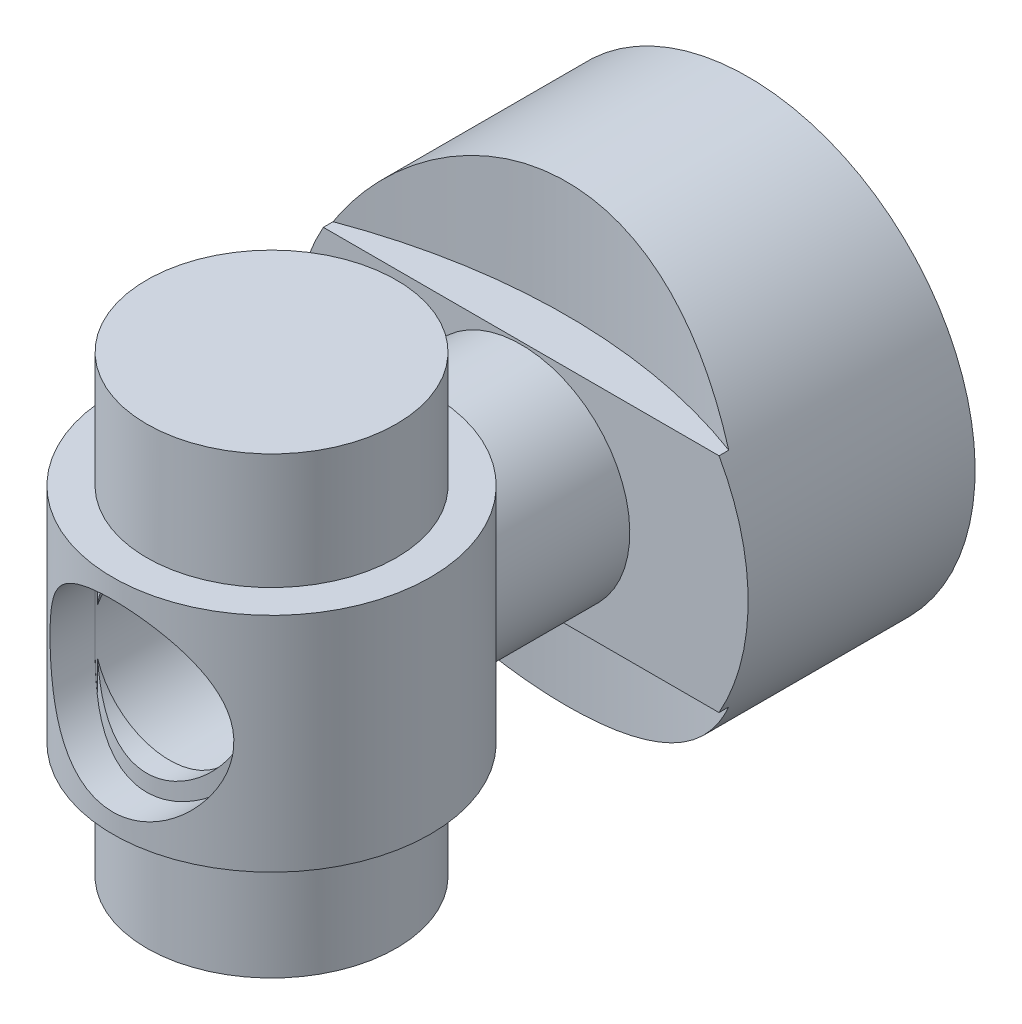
ISO-10303-21;
HEADER;
FILE_DESCRIPTION(('STEP AP214'),'2;1');
FILE_NAME('part.step','',(''),(''),'','','');
FILE_SCHEMA(('AUTOMOTIVE_DESIGN { 1 0 10303 214 1 1 1 1 }'));
ENDSEC;
DATA;
#1=APPLICATION_CONTEXT('core data for automotive mechanical design processes');
#2=APPLICATION_PROTOCOL_DEFINITION('international standard','automotive_design',2000,#1);
#3=PRODUCT_CONTEXT('',#1,'mechanical');
#4=PRODUCT('Part','Part','',(#3));
#5=PRODUCT_RELATED_PRODUCT_CATEGORY('part','',(#4));
#6=PRODUCT_DEFINITION_FORMATION('','',#4);
#7=PRODUCT_DEFINITION_CONTEXT('part definition',#1,'design');
#8=PRODUCT_DEFINITION('design','',#6,#7);
#9=PRODUCT_DEFINITION_SHAPE('','',#8);
#10=(LENGTH_UNIT() NAMED_UNIT(*) SI_UNIT(.MILLI.,.METRE.));
#11=(NAMED_UNIT(*) PLANE_ANGLE_UNIT() SI_UNIT($,.RADIAN.));
#12=(NAMED_UNIT(*) SI_UNIT($,.STERADIAN.) SOLID_ANGLE_UNIT());
#13=UNCERTAINTY_MEASURE_WITH_UNIT(LENGTH_MEASURE(1.E-05),#10,'distance_accuracy_value','');
#14=(GEOMETRIC_REPRESENTATION_CONTEXT(3) GLOBAL_UNCERTAINTY_ASSIGNED_CONTEXT((#13)) GLOBAL_UNIT_ASSIGNED_CONTEXT((#10,
#11,#12)) REPRESENTATION_CONTEXT('',''));
#15=CARTESIAN_POINT('',(0.,0.,0.));
#16=DIRECTION('',(0.,0.,1.));
#17=DIRECTION('',(1.,0.,0.));
#18=AXIS2_PLACEMENT_3D('',#15,#16,#17);
#19=CARTESIAN_POINT('',(0.,-10.,21.));
#20=DIRECTION('',(0.,1.,0.));
#21=DIRECTION('',(-1.,0.,0.));
#22=AXIS2_PLACEMENT_3D('',#19,#20,#21);
#23=CYLINDRICAL_SURFACE('',#22,5.5);
#24=CARTESIAN_POINT('',(0.,-4.05,26.5));
#25=CARTESIAN_POINT('',(0.0993570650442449,-4.04999906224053,26.4999990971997));
#26=CARTESIAN_POINT('',(0.198736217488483,-4.04633711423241,26.4973010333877));
#27=CARTESIAN_POINT('',(0.396711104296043,-4.03174697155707,26.4865708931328));
#28=CARTESIAN_POINT('',(0.495306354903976,-4.02081459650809,26.4785357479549));
#29=CARTESIAN_POINT('',(0.691072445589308,-3.99183199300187,26.4573000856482));
#30=CARTESIAN_POINT('',(0.788240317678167,-3.97376865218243,26.444090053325));
#31=CARTESIAN_POINT('',(0.980271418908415,-3.93081016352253,26.4128140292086));
#32=CARTESIAN_POINT('',(1.07513360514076,-3.90591198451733,26.3947458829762));
#33=CARTESIAN_POINT('',(1.35409912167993,-3.82183066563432,26.3340754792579));
#34=CARTESIAN_POINT('',(1.53398234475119,-3.75304653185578,26.2848469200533));
#35=CARTESIAN_POINT('',(1.87842899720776,-3.59307140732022,26.1724686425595));
#36=CARTESIAN_POINT('',(2.04299662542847,-3.50188658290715,26.10932275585));
#37=CARTESIAN_POINT('',(2.3694507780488,-3.29080050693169,25.9669140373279));
#38=CARTESIAN_POINT('',(2.52971012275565,-3.16903363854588,25.886704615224));
#39=CARTESIAN_POINT('',(2.82896593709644,-2.90505815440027,25.71978230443));
#40=CARTESIAN_POINT('',(2.96792857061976,-2.76281769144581,25.6330593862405));
#41=CARTESIAN_POINT('',(3.17207728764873,-2.52080567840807,25.494051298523));
#42=CARTESIAN_POINT('',(3.24447848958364,-2.42692197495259,25.4419240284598));
#43=CARTESIAN_POINT('',(3.38108588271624,-2.23268066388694,25.338844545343));
#44=CARTESIAN_POINT('',(3.44528968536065,-2.1323211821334,25.2878926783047));
#45=CARTESIAN_POINT('',(3.56504933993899,-1.92540561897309,25.1888488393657));
#46=CARTESIAN_POINT('',(3.62061622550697,-1.81885768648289,25.1407532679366));
#47=CARTESIAN_POINT('',(3.72268090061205,-1.59961965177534,25.0492398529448));
#48=CARTESIAN_POINT('',(3.76918031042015,-1.48693065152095,25.0058211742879));
#49=CARTESIAN_POINT('',(3.86611887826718,-1.21747318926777,24.9126744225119));
#50=CARTESIAN_POINT('',(3.91284278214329,-1.05837570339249,24.8655521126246));
#51=CARTESIAN_POINT('',(3.96833386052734,-0.813533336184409,24.8082844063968));
#52=CARTESIAN_POINT('',(3.98439338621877,-0.730935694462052,24.7914369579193));
#53=CARTESIAN_POINT('',(4.01141882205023,-0.564049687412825,24.762832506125));
#54=CARTESIAN_POINT('',(4.02238684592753,-0.479762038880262,24.7510733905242));
#55=CARTESIAN_POINT('',(4.03908228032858,-0.309361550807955,24.7330909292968));
#56=CARTESIAN_POINT('',(4.04476533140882,-0.223239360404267,24.7269144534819));
#57=CARTESIAN_POINT('',(4.05060492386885,-0.0505861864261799,24.720567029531));
#58=CARTESIAN_POINT('',(4.05076169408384,0.0359447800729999,24.7203958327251));
#59=CARTESIAN_POINT('',(4.04554383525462,0.208670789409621,24.7260688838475));
#60=CARTESIAN_POINT('',(4.04016718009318,0.294865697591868,24.7319153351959));
#61=CARTESIAN_POINT('',(4.02399993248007,0.466191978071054,24.7493418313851));
#62=CARTESIAN_POINT('',(4.01320661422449,0.551322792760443,24.7609247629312));
#63=CARTESIAN_POINT('',(3.98502218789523,0.728683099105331,24.7907862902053));
#64=CARTESIAN_POINT('',(3.96705962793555,0.82072512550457,24.8096379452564));
#65=CARTESIAN_POINT('',(3.92515914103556,1.00215252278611,24.8527952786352));
#66=CARTESIAN_POINT('',(3.90121721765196,1.09153607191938,24.8771046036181));
#67=CARTESIAN_POINT('',(3.82090378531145,1.35536092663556,24.9568116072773));
#68=CARTESIAN_POINT('',(3.75607760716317,1.52527663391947,25.0189509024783));
#69=CARTESIAN_POINT('',(3.63064807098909,1.79881292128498,25.1319575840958));
#70=CARTESIAN_POINT('',(3.57538534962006,1.90618715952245,25.1800277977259));
#71=CARTESIAN_POINT('',(3.45617502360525,2.11465338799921,25.2791186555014));
#72=CARTESIAN_POINT('',(3.39222454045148,2.2157432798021,25.3301402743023));
#73=CARTESIAN_POINT('',(3.25597774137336,2.41150281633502,25.4335008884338));
#74=CARTESIAN_POINT('',(3.18367605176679,2.50616826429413,25.4858407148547));
#75=CARTESIAN_POINT('',(3.0309513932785,2.68886837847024,25.5904143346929));
#76=CARTESIAN_POINT('',(2.95052439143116,2.77689971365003,25.6426480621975));
#77=CARTESIAN_POINT('',(2.78051000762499,2.94719390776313,25.7464544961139));
#78=CARTESIAN_POINT('',(2.69080481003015,3.02935228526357,25.7980060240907));
#79=CARTESIAN_POINT('',(2.50345701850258,3.18592277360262,25.8983667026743));
#80=CARTESIAN_POINT('',(2.40581545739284,3.26033588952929,25.947176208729));
#81=CARTESIAN_POINT('',(2.20303487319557,3.40063241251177,26.0407414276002));
#82=CARTESIAN_POINT('',(2.09790983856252,3.46653111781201,26.0855043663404));
#83=CARTESIAN_POINT('',(1.88051729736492,3.5891132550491,26.1698414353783));
#84=CARTESIAN_POINT('',(1.76825248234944,3.64580013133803,26.2094175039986));
#85=CARTESIAN_POINT('',(1.48073538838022,3.77429697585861,26.2999833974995));
#86=CARTESIAN_POINT('',(1.30144840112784,3.84001502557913,26.3471370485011));
#87=CARTESIAN_POINT('',(0.931961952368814,3.94599025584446,26.4237439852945));
#88=CARTESIAN_POINT('',(0.741770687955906,3.98626629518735,26.453210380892));
#89=CARTESIAN_POINT('',(0.354695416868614,4.0391783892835,26.4920060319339));
#90=CARTESIAN_POINT('',(0.157787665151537,4.05170314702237,26.5012541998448));
#91=CARTESIAN_POINT('',(-0.235599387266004,4.04792309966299,26.4984705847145));
#92=CARTESIAN_POINT('',(-0.432078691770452,4.03161855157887,26.486438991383));
#93=CARTESIAN_POINT('',(-0.806141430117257,3.97318966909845,26.4436548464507));
#94=CARTESIAN_POINT('',(-0.984136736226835,3.9327506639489,26.4141250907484));
#95=CARTESIAN_POINT('',(-1.33010781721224,3.82961187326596,26.3396775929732));
#96=CARTESIAN_POINT('',(-1.49808147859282,3.76690741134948,26.2947566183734));
#97=CARTESIAN_POINT('',(-1.83368497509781,3.61614914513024,26.1885399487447));
#98=CARTESIAN_POINT('',(-2.00027735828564,3.52650625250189,26.1262443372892));
#99=CARTESIAN_POINT('',(-2.31650130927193,3.32735557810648,25.9913355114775));
#100=CARTESIAN_POINT('',(-2.46612272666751,3.21783600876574,25.9187161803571));
#101=CARTESIAN_POINT('',(-2.7731254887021,2.95965715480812,25.7534668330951));
#102=CARTESIAN_POINT('',(-2.926904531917,2.80750324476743,25.6596084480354));
#103=CARTESIAN_POINT('',(-3.20827510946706,2.48112331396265,25.4705378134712));
#104=CARTESIAN_POINT('',(-3.33584080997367,2.30687579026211,25.375324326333));
#105=CARTESIAN_POINT('',(-3.552786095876,1.95425132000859,25.2006302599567));
#106=CARTESIAN_POINT('',(-3.64458120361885,1.77768582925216,25.1205061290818));
#107=CARTESIAN_POINT('',(-3.80271479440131,1.40787267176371,24.9750347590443));
#108=CARTESIAN_POINT('',(-3.86910593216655,1.21466053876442,24.9096570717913));
#109=CARTESIAN_POINT('',(-3.96047028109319,0.861433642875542,24.8167919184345));
#110=CARTESIAN_POINT('',(-3.99153435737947,0.704426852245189,24.7839939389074));
#111=CARTESIAN_POINT('',(-4.03485153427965,0.385128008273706,24.7377830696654));
#112=CARTESIAN_POINT('',(-4.04713479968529,0.222844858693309,24.7243390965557));
#113=CARTESIAN_POINT('',(-4.05197594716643,-0.102823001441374,24.7190744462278));
#114=CARTESIAN_POINT('',(-4.0444810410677,-0.266209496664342,24.7273116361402));
#115=CARTESIAN_POINT('',(-4.0102782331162,-0.588690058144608,24.7640736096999));
#116=CARTESIAN_POINT('',(-3.98354421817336,-0.747777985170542,24.7926259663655));
#117=CARTESIAN_POINT('',(-3.9027515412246,-1.10108775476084,24.8759147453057));
#118=CARTESIAN_POINT('',(-3.84317012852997,-1.2928133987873,24.9357175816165));
#119=CARTESIAN_POINT('',(-3.69912200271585,-1.66079969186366,25.0713935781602));
#120=CARTESIAN_POINT('',(-3.61458958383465,-1.83701789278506,25.147309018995));
#121=CARTESIAN_POINT('',(-3.45747436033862,-2.11275748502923,25.2781195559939));
#122=CARTESIAN_POINT('',(-3.3914376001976,-2.21716169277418,25.3308171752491));
#123=CARTESIAN_POINT('',(-3.25047521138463,-2.4191077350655,25.4375916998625));
#124=CARTESIAN_POINT('',(-3.17554705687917,-2.51664760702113,25.4916689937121));
#125=CARTESIAN_POINT('',(-3.01713889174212,-2.70452474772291,25.5995707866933));
#126=CARTESIAN_POINT('',(-2.93366523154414,-2.79486727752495,25.6533954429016));
#127=CARTESIAN_POINT('',(-2.75832473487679,-2.96805300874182,25.7594282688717));
#128=CARTESIAN_POINT('',(-2.66645619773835,-3.05089468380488,25.8116361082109));
#129=CARTESIAN_POINT('',(-2.40810862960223,-3.26306939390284,25.9481983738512));
#130=CARTESIAN_POINT('',(-2.23392568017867,-3.3849902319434,26.0298481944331));
#131=CARTESIAN_POINT('',(-1.86395112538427,-3.60195515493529,26.1783546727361));
#132=CARTESIAN_POINT('',(-1.66818307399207,-3.69702814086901,26.2452272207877));
#133=CARTESIAN_POINT('',(-1.28996040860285,-3.84356560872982,26.3496054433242));
#134=CARTESIAN_POINT('',(-1.11007473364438,-3.89948380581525,26.3900432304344));
#135=CARTESIAN_POINT('',(-0.833834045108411,-3.96436505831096,26.4372312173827));
#136=CARTESIAN_POINT('',(-0.740750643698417,-3.98282002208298,26.450711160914));
#137=CARTESIAN_POINT('',(-0.552981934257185,-4.01319498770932,26.4729446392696));
#138=CARTESIAN_POINT('',(-0.458297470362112,-4.02511832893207,26.4817005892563));
#139=CARTESIAN_POINT('',(-0.302888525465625,-4.03911218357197,26.4919864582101));
#140=CARTESIAN_POINT('',(-0.242430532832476,-4.04319201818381,26.4949884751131));
#141=CARTESIAN_POINT('',(-0.121317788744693,-4.04863640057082,26.4989956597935));
#142=CARTESIAN_POINT('',(-0.060663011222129,-4.05000057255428,26.5000005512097));
#143=CARTESIAN_POINT('',(0.,-4.05,26.5));
#144=B_SPLINE_CURVE_WITH_KNOTS('',3,(#24,#25,#26,#27,#28,#29,#30,#31,#32,#33,#34,#35,#36,#37,
#38,#39,#40,#41,#42,#43,#44,#45,#46,#47,#48,#49,#50,#51,#52,#53,#54,#55,#56,#57,#58,#59,#60,#61,
#62,#63,#64,#65,#66,#67,#68,#69,#70,#71,#72,#73,#74,#75,#76,#77,#78,#79,#80,#81,#82,#83,#84,#85,
#86,#87,#88,#89,#90,#91,#92,#93,#94,#95,#96,#97,#98,#99,#100,#101,#102,#103,#104,#105,#106,#107,
#108,#109,#110,#111,#112,#113,#114,#115,#116,#117,#118,#119,#120,#121,#122,#123,#124,#125,#126,
#127,#128,#129,#130,#131,#132,#133,#134,#135,#136,#137,#138,#139,#140,#141,#142,#143),
.UNSPECIFIED.,.T.,.F.,(4,2,2,2,2,2,2,2,2,2,2,2,2,2,2,2,2,2,2,2,2,2,2,2,2,2,2,2,2,2,2,2,2,2,2,2,
2,2,2,2,2,2,2,2,2,2,2,2,2,2,2,2,2,2,2,2,2,2,2,4),(0.,0.298005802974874,0.596183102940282,
0.894911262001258,1.19377211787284,1.78727078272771,2.3806062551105,3.02830528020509,
3.67702292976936,4.06519337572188,4.45347666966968,4.84125978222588,5.22897353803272,
5.7439288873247,6.00111157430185,6.25818739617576,6.5174020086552,6.77660588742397,
7.03590470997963,7.29533414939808,7.58186491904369,7.86858771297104,8.4426434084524,
8.83217554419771,9.22183705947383,9.61175071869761,10.0018588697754,10.3977324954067,
10.7935546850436,11.1886554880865,11.5836082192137,12.1710259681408,12.7580077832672,
13.3473394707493,13.9366659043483,14.4889922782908,15.0414347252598,15.6367315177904,
16.2323825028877,16.9371857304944,17.6426802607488,18.2841179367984,18.9242188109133,
19.4123615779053,19.8997194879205,20.3883794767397,20.8777039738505,21.502770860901,
22.129498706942,22.5319871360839,22.934590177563,23.33689617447,23.7392838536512,
24.419617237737,25.0992154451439,25.6744980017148,25.9617485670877,26.2488521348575,
26.4307760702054,26.6127251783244),.UNSPECIFIED.);
#145=CARTESIAN_POINT('',(0.,-4.05,26.5));
#146=VERTEX_POINT('',#145);
#147=EDGE_CURVE('E161',#146,#146,#144,.T.);
#148=ORIENTED_EDGE('',*,*,#147,.T.);
#149=EDGE_LOOP('',(#148));
#150=FACE_BOUND('',#149,.T.);
#151=CARTESIAN_POINT('',(-3.16227766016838,2.44948974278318,25.5));
#152=CARTESIAN_POINT('',(-3.22421943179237,2.36949887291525,25.4564842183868));
#153=CARTESIAN_POINT('',(-3.2831985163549,2.28711169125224,25.4131151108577));
#154=CARTESIAN_POINT('',(-3.39507587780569,2.11750534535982,25.3276314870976));
#155=CARTESIAN_POINT('',(-3.4479658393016,2.03027980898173,25.2855187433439));
#156=CARTESIAN_POINT('',(-3.54794996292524,1.85007626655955,25.2031303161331));
#157=CARTESIAN_POINT('',(-3.59496515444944,1.75704086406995,25.1628834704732));
#158=CARTESIAN_POINT('',(-3.68203424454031,1.56640309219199,25.0860728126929));
#159=CARTESIAN_POINT('',(-3.72209193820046,1.46880324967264,25.0495069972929));
#160=CARTESIAN_POINT('',(-3.81529149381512,1.21286899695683,24.9622745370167));
#161=CARTESIAN_POINT('',(-3.86313926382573,1.05122105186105,24.9152284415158));
#162=CARTESIAN_POINT('',(-3.91956256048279,0.802640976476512,24.8584628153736));
#163=CARTESIAN_POINT('',(-3.93579551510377,0.718931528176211,24.8418604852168));
#164=CARTESIAN_POINT('',(-3.96295637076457,0.549815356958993,24.8138379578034));
#165=CARTESIAN_POINT('',(-3.9738870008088,0.464409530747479,24.8024150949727));
#166=CARTESIAN_POINT('',(-3.99030255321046,0.291689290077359,24.7851856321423));
#167=CARTESIAN_POINT('',(-3.9957352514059,0.204364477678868,24.7794329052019));
#168=CARTESIAN_POINT('',(-4.00084992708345,0.0293564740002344,24.774018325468));
#169=CARTESIAN_POINT('',(-4.00053206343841,-0.0583267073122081,24.7743563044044));
#170=CARTESIAN_POINT('',(-3.99414979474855,-0.233327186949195,24.781109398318));
#171=CARTESIAN_POINT('',(-3.98808002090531,-0.320644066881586,24.7875301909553));
#172=CARTESIAN_POINT('',(-3.97032220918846,-0.494115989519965,24.8061404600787));
#173=CARTESIAN_POINT('',(-3.95863124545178,-0.580270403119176,24.8183329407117));
#174=CARTESIAN_POINT('',(-3.92850200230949,-0.758832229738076,24.8493350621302));
#175=CARTESIAN_POINT('',(-3.90952971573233,-0.851059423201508,24.8686618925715));
#176=CARTESIAN_POINT('',(-3.86550619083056,-1.03277089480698,24.9126501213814));
#177=CARTESIAN_POINT('',(-3.84045104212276,-1.12225336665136,24.937314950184));
#178=CARTESIAN_POINT('',(-3.75660923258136,-1.38637951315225,25.0179448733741));
#179=CARTESIAN_POINT('',(-3.68920668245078,-1.55635630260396,25.0804788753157));
#180=CARTESIAN_POINT('',(-3.54909547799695,-1.85072041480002,25.2024776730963));
#181=CARTESIAN_POINT('',(-3.47991505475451,-1.97757920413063,25.2602098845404));
#182=CARTESIAN_POINT('',(-3.36717372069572,-2.16037073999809,25.3490701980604));
#183=CARTESIAN_POINT('',(-3.32827314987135,-2.21982651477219,25.3789421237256));
#184=CARTESIAN_POINT('',(-3.24749442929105,-2.33640885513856,25.4391801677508));
#185=CARTESIAN_POINT('',(-3.20561661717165,-2.39353568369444,25.4695462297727));
#186=CARTESIAN_POINT('',(-3.16227766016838,-2.44948974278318,25.5));
#187=B_SPLINE_CURVE_WITH_KNOTS('',3,(#151,#152,#153,#154,#155,#156,#157,#158,#159,#160,#161,
#162,#163,#164,#165,#166,#167,#168,#169,#170,#171,#172,#173,#174,#175,#176,#177,#178,#179,#180,
#181,#182,#183,#184,#185,#186),.UNSPECIFIED.,.F.,.F.,(4,2,2,2,2,2,2,2,2,2,2,2,2,2,2,2,2,4),(0.,
0.330351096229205,0.661148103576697,0.995999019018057,1.33066670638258,1.85336955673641,
2.11371084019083,2.37391798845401,2.63657424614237,2.89922324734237,3.16211764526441,
3.42514902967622,3.71308263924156,4.00120184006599,4.57849810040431,5.04449648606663,
5.27563548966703,5.50674832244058),.UNSPECIFIED.);
#188=CARTESIAN_POINT('',(-3.16227766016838,2.44948974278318,25.5));
#189=VERTEX_POINT('',#188);
#190=CARTESIAN_POINT('',(-3.16227766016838,-2.44948974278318,25.5));
#191=VERTEX_POINT('',#190);
#192=EDGE_CURVE('E98',#189,#191,#187,.T.);
#193=ORIENTED_EDGE('',*,*,#192,.F.);
#194=DIRECTION('',(0.,1.,0.));
#195=VECTOR('',#194,1.);
#196=CARTESIAN_POINT('',(-3.16227766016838,-10.,25.5));
#197=LINE('',#196,#195);
#198=CARTESIAN_POINT('',(-3.16227766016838,1.02257139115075,25.5));
#199=VERTEX_POINT('',#198);
#200=EDGE_CURVE('E102',#189,#199,#197,.F.);
#201=ORIENTED_EDGE('',*,*,#200,.T.);
#202=CARTESIAN_POINT('',(3.3235,0.,25.3822765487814));
#203=CARTESIAN_POINT('',(3.32349911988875,0.0833292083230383,25.3822778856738));
#204=CARTESIAN_POINT('',(3.3203594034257,0.166689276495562,25.3846638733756));
#205=CARTESIAN_POINT('',(3.3078535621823,0.332712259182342,25.3941055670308));
#206=CARTESIAN_POINT('',(3.29848300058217,0.415374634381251,25.4011646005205));
#207=CARTESIAN_POINT('',(3.27364501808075,0.579483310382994,25.4196705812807));
#208=CARTESIAN_POINT('',(3.25816320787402,0.66092626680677,25.4311278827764));
#209=CARTESIAN_POINT('',(3.22134571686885,0.821832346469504,25.4579645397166));
#210=CARTESIAN_POINT('',(3.20000715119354,0.901294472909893,25.4733458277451));
#211=CARTESIAN_POINT('',(3.12803400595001,1.1346153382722,25.5242509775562));
#212=CARTESIAN_POINT('',(3.06920134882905,1.28494760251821,25.5647276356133));
#213=CARTESIAN_POINT('',(2.93186432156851,1.57334206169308,25.6541232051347));
#214=CARTESIAN_POINT('',(2.85336193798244,1.71140549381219,25.7030412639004));
#215=CARTESIAN_POINT('',(2.66748262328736,1.99038627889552,25.8111811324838));
#216=CARTESIAN_POINT('',(2.5577284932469,2.12952188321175,25.8709276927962));
#217=CARTESIAN_POINT('',(2.31737139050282,2.38888604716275,25.9897721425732));
#218=CARTESIAN_POINT('',(2.18675112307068,2.50909875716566,26.0488694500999));
#219=CARTESIAN_POINT('',(1.89076420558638,2.74036179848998,26.1674957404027));
#220=CARTESIAN_POINT('',(1.7231556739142,2.84894800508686,26.2263565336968));
#221=CARTESIAN_POINT('',(1.4569246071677,2.98883133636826,26.3043369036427));
#222=CARTESIAN_POINT('',(1.365681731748,3.03163579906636,26.3286176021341));
#223=CARTESIAN_POINT('',(1.17883903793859,3.10905008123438,26.3730371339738));
#224=CARTESIAN_POINT('',(1.08324217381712,3.14366536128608,26.3931787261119));
#225=CARTESIAN_POINT('',(0.897823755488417,3.20126029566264,26.4269629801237));
#226=CARTESIAN_POINT('',(0.808328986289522,3.22503803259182,26.44104395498));
#227=CARTESIAN_POINT('',(0.627158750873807,3.26510710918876,26.4648890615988));
#228=CARTESIAN_POINT('',(0.53548453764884,3.28140264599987,26.4746556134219));
#229=CARTESIAN_POINT('',(0.350764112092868,3.30625037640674,26.4895845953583));
#230=CARTESIAN_POINT('',(0.257718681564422,3.31480682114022,26.4947495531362));
#231=CARTESIAN_POINT('',(0.0711277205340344,3.3240537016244,26.5003338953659));
#232=CARTESIAN_POINT('',(-0.0224177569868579,3.32474495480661,26.5007537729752));
#233=CARTESIAN_POINT('',(-0.278953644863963,3.315781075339,26.4953337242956));
#234=CARTESIAN_POINT('',(-0.441651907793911,3.29801660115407,26.4845865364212));
#235=CARTESIAN_POINT('',(-0.761142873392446,3.23925299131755,26.4494559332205));
#236=CARTESIAN_POINT('',(-0.917935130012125,3.19825210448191,26.4250714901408));
#237=CARTESIAN_POINT('',(-1.22270945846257,3.09462088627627,26.3646292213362));
#238=CARTESIAN_POINT('',(-1.37064057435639,3.0318773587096,26.3285103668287));
#239=CARTESIAN_POINT('',(-1.65403755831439,2.88706944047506,26.2474681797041));
#240=CARTESIAN_POINT('',(-1.78950025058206,2.80500014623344,26.2025426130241));
#241=CARTESIAN_POINT('',(-2.06160271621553,2.61274603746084,26.1013049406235));
#242=CARTESIAN_POINT('',(-2.19642236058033,2.50036629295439,26.044273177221));
#243=CARTESIAN_POINT('',(-2.4464483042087,2.25635117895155,25.9278756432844));
#244=CARTESIAN_POINT('',(-2.56162720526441,2.12468937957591,25.8685067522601));
#245=CARTESIAN_POINT('',(-2.78289616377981,1.82741281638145,25.7458711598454));
#246=CARTESIAN_POINT('',(-2.88629628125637,1.65962379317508,25.6829749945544));
#247=CARTESIAN_POINT('',(-3.062895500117,1.30512353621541,25.5694364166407));
#248=CARTESIAN_POINT('',(-3.13615037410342,1.11844804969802,25.5187714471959));
#249=CARTESIAN_POINT('',(-3.23438198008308,0.7793068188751,25.4487592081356));
#250=CARTESIAN_POINT('',(-3.26685405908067,0.629977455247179,25.4247468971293));
#251=CARTESIAN_POINT('',(-3.31093990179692,0.326702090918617,25.3918639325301));
#252=CARTESIAN_POINT('',(-3.32257861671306,0.172761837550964,25.3829751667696));
#253=CARTESIAN_POINT('',(-3.32431718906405,-0.135543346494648,25.3816569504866));
#254=CARTESIAN_POINT('',(-3.31438419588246,-0.289908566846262,25.3892526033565));
#255=CARTESIAN_POINT('',(-3.27354081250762,-0.594316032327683,25.4197907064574));
#256=CARTESIAN_POINT('',(-3.24261367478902,-0.744354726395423,25.4427454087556));
#257=CARTESIAN_POINT('',(-3.16153602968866,-1.03594739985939,25.5007923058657));
#258=CARTESIAN_POINT('',(-3.11145579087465,-1.17753023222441,25.5358400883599));
#259=CARTESIAN_POINT('',(-2.99386164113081,-1.45072167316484,25.6143019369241));
#260=CARTESIAN_POINT('',(-2.92634123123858,-1.58232653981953,25.6577191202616));
#261=CARTESIAN_POINT('',(-2.76159656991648,-1.8572499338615,25.7575669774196));
#262=CARTESIAN_POINT('',(-2.66120186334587,-1.99833468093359,25.8149274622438));
#263=CARTESIAN_POINT('',(-2.44003232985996,-2.2631226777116,25.9307079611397));
#264=CARTESIAN_POINT('',(-2.31923766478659,-2.38680879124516,25.9891289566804));
#265=CARTESIAN_POINT('',(-2.04109217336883,-2.63022749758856,26.1097750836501));
#266=CARTESIAN_POINT('',(-1.88100795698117,-2.74717416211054,26.1714496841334));
#267=CARTESIAN_POINT('',(-1.62516509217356,-2.90076197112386,26.2551834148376));
#268=CARTESIAN_POINT('',(-1.53722586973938,-2.9483340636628,26.2816405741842));
#269=CARTESIAN_POINT('',(-1.35659771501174,-3.03567747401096,26.3308890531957));
#270=CARTESIAN_POINT('',(-1.26391182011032,-3.07545370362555,26.3536826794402));
#271=CARTESIAN_POINT('',(-1.08111529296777,-3.14415294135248,26.3934515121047));
#272=CARTESIAN_POINT('',(-0.991281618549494,-3.17364232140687,26.4107230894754));
#273=CARTESIAN_POINT('',(-0.808797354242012,-3.22497664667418,26.4409917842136));
#274=CARTESIAN_POINT('',(-0.716148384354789,-3.24682590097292,26.4539913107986));
#275=CARTESIAN_POINT('',(-0.528860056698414,-3.28253570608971,26.4753249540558));
#276=CARTESIAN_POINT('',(-0.434222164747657,-3.29640194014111,26.4836623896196));
#277=CARTESIAN_POINT('',(-0.243806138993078,-3.31592644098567,26.4954212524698));
#278=CARTESIAN_POINT('',(-0.148028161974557,-3.32158582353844,26.498843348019));
#279=CARTESIAN_POINT('',(0.030641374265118,-3.3243904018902,26.5005380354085));
#280=CARTESIAN_POINT('',(0.113511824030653,-3.32258999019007,26.4994483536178));
#281=CARTESIAN_POINT('',(0.278763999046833,-3.31282474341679,26.4935548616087));
#282=CARTESIAN_POINT('',(0.361145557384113,-3.30485791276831,26.4887498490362));
#283=CARTESIAN_POINT('',(0.606555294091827,-3.27183454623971,26.4689031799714));
#284=CARTESIAN_POINT('',(0.768034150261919,-3.23765773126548,26.4484313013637));
#285=CARTESIAN_POINT('',(1.07910076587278,-3.14753673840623,26.3953732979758));
#286=CARTESIAN_POINT('',(1.22885605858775,-3.0920180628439,26.3630245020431));
#287=CARTESIAN_POINT('',(1.51694846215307,-2.96134187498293,26.2887620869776));
#288=CARTESIAN_POINT('',(1.65528318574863,-2.88618027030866,26.2468464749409));
#289=CARTESIAN_POINT('',(1.93270004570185,-2.70928865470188,26.1515477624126));
#290=CARTESIAN_POINT('',(2.07025026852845,-2.60556626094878,26.0974151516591));
#291=CARTESIAN_POINT('',(2.32706124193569,-2.37903608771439,25.9854243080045));
#292=CARTESIAN_POINT('',(2.44630046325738,-2.25620617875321,25.9275618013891));
#293=CARTESIAN_POINT('',(2.67904554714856,-1.97627936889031,25.8054274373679));
#294=CARTESIAN_POINT('',(2.78978667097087,-1.81680331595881,25.7413012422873));
#295=CARTESIAN_POINT('',(2.98293771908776,-1.47838441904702,25.6222265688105));
#296=CARTESIAN_POINT('',(3.06537022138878,-1.29945723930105,25.5672707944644));
#297=CARTESIAN_POINT('',(3.18332386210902,-0.967353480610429,25.4855806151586));
#298=CARTESIAN_POINT('',(3.2252104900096,-0.817351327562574,25.4552844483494));
#299=CARTESIAN_POINT('',(3.27204912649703,-0.58775255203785,25.4208652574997));
#300=CARTESIAN_POINT('',(3.28499149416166,-0.51053820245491,25.4112341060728));
#301=CARTESIAN_POINT('',(3.30541246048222,-0.355016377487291,25.3959547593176));
#302=CARTESIAN_POINT('',(3.31289440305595,-0.27670960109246,25.3903041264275));
#303=CARTESIAN_POINT('',(3.31955633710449,-0.165200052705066,25.3852650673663));
#304=CARTESIAN_POINT('',(3.3210344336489,-0.132191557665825,25.3841455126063));
#305=CARTESIAN_POINT('',(3.32300651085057,-0.0661236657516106,25.3826509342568));
#306=CARTESIAN_POINT('',(3.32350034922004,-0.0330642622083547,25.3822760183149));
#307=CARTESIAN_POINT('',(3.3235,0.,25.3822765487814));
#308=B_SPLINE_CURVE_WITH_KNOTS('',3,(#202,#203,#204,#205,#206,#207,#208,#209,#210,#211,#212,
#213,#214,#215,#216,#217,#218,#219,#220,#221,#222,#223,#224,#225,#226,#227,#228,#229,#230,#231,
#232,#233,#234,#235,#236,#237,#238,#239,#240,#241,#242,#243,#244,#245,#246,#247,#248,#249,#250,
#251,#252,#253,#254,#255,#256,#257,#258,#259,#260,#261,#262,#263,#264,#265,#266,#267,#268,#269,
#270,#271,#272,#273,#274,#275,#276,#277,#278,#279,#280,#281,#282,#283,#284,#285,#286,#287,#288,
#289,#290,#291,#292,#293,#294,#295,#296,#297,#298,#299,#300,#301,#302,#303,#304,#305,#306,#307),
.UNSPECIFIED.,.T.,.F.,(4,2,2,2,2,2,2,2,2,2,2,2,2,2,2,2,2,2,2,2,2,2,2,2,2,2,2,2,2,2,2,2,2,2,2,2,
2,2,2,2,2,2,2,2,2,2,2,2,2,2,2,2,4),(0.,0.249948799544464,0.500075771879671,0.750795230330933,
1.00163840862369,1.49867656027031,1.99566453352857,2.5544808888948,3.11376284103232,
3.73459233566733,4.04519272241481,4.35558541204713,4.63617561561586,4.91660822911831,
5.19688670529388,5.47713605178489,5.96660521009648,6.45611126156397,6.94820504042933,
7.44042381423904,7.99187692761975,8.54409311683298,9.16167922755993,9.77811753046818,
10.240221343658,10.7017713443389,11.1640247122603,11.6266472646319,12.0875885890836,
12.548701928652,13.0938192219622,13.6394697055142,14.2587541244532,14.568647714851,
14.8783454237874,15.1662732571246,15.4540384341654,15.7415984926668,16.0291194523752,
16.277490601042,16.5259421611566,17.022295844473,17.5092277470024,17.9962611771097,
18.5358791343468,19.0761267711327,19.6866692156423,20.2967235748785,20.7705222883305,
21.0069196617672,21.2431721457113,21.3423351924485,21.4415125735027),.UNSPECIFIED.);
#309=CARTESIAN_POINT('',(3.16227766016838,1.02257139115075,25.5));
#310=VERTEX_POINT('',#309);
#311=EDGE_CURVE('E106',#310,#199,#308,.T.);
#312=ORIENTED_EDGE('',*,*,#311,.F.);
#313=DIRECTION('',(0.,1.,0.));
#314=VECTOR('',#313,1.);
#315=CARTESIAN_POINT('',(3.16227766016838,-10.,25.5));
#316=LINE('',#315,#314);
#317=CARTESIAN_POINT('',(3.16227766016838,2.44948974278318,25.5));
#318=VERTEX_POINT('',#317);
#319=EDGE_CURVE('E36',#310,#318,#316,.T.);
#320=ORIENTED_EDGE('',*,*,#319,.T.);
#321=CARTESIAN_POINT('',(3.16227766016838,-2.44948974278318,25.5));
#322=CARTESIAN_POINT('',(3.22421943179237,-2.36949887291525,25.4564842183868));
#323=CARTESIAN_POINT('',(3.2831985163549,-2.28711169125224,25.4131151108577));
#324=CARTESIAN_POINT('',(3.39507587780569,-2.11750534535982,25.3276314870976));
#325=CARTESIAN_POINT('',(3.4479658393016,-2.03027980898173,25.2855187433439));
#326=CARTESIAN_POINT('',(3.54794996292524,-1.85007626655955,25.2031303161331));
#327=CARTESIAN_POINT('',(3.59496515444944,-1.75704086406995,25.1628834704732));
#328=CARTESIAN_POINT('',(3.68203424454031,-1.56640309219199,25.0860728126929));
#329=CARTESIAN_POINT('',(3.72209193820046,-1.46880324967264,25.0495069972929));
#330=CARTESIAN_POINT('',(3.81529149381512,-1.21286899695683,24.9622745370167));
#331=CARTESIAN_POINT('',(3.86313926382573,-1.05122105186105,24.9152284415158));
#332=CARTESIAN_POINT('',(3.91956256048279,-0.802640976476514,24.8584628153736));
#333=CARTESIAN_POINT('',(3.93579551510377,-0.718931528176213,24.8418604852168));
#334=CARTESIAN_POINT('',(3.96295637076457,-0.549815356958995,24.8138379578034));
#335=CARTESIAN_POINT('',(3.9738870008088,-0.464409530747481,24.8024150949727));
#336=CARTESIAN_POINT('',(3.99030255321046,-0.291689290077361,24.7851856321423));
#337=CARTESIAN_POINT('',(3.9957352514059,-0.20436447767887,24.7794329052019));
#338=CARTESIAN_POINT('',(4.00084992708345,-0.0293564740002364,24.774018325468));
#339=CARTESIAN_POINT('',(4.00053206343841,0.0583267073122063,24.7743563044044));
#340=CARTESIAN_POINT('',(3.99414979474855,0.233327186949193,24.781109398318));
#341=CARTESIAN_POINT('',(3.98808002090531,0.320644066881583,24.7875301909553));
#342=CARTESIAN_POINT('',(3.97032220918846,0.494115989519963,24.8061404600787));
#343=CARTESIAN_POINT('',(3.95863124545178,0.580270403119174,24.8183329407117));
#344=CARTESIAN_POINT('',(3.92850200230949,0.758832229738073,24.8493350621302));
#345=CARTESIAN_POINT('',(3.90952971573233,0.851059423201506,24.8686618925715));
#346=CARTESIAN_POINT('',(3.86550619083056,1.03277089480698,24.9126501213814));
#347=CARTESIAN_POINT('',(3.84045104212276,1.12225336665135,24.937314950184));
#348=CARTESIAN_POINT('',(3.75660923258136,1.38637951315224,25.0179448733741));
#349=CARTESIAN_POINT('',(3.68920668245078,1.55635630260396,25.0804788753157));
#350=CARTESIAN_POINT('',(3.54909547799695,1.85072041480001,25.2024776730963));
#351=CARTESIAN_POINT('',(3.47991505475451,1.97757920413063,25.2602098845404));
#352=CARTESIAN_POINT('',(3.36717372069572,2.16037073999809,25.3490701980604));
#353=CARTESIAN_POINT('',(3.32827314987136,2.21982651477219,25.3789421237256));
#354=CARTESIAN_POINT('',(3.24749442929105,2.33640885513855,25.4391801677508));
#355=CARTESIAN_POINT('',(3.20561661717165,2.39353568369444,25.4695462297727));
#356=CARTESIAN_POINT('',(3.16227766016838,2.44948974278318,25.5));
#357=B_SPLINE_CURVE_WITH_KNOTS('',3,(#321,#322,#323,#324,#325,#326,#327,#328,#329,#330,#331,
#332,#333,#334,#335,#336,#337,#338,#339,#340,#341,#342,#343,#344,#345,#346,#347,#348,#349,#350,
#351,#352,#353,#354,#355,#356),.UNSPECIFIED.,.F.,.F.,(4,2,2,2,2,2,2,2,2,2,2,2,2,2,2,2,2,4),(0.,
0.330351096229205,0.661148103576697,0.995999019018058,1.33066670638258,1.85336955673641,
2.11371084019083,2.37391798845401,2.63657424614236,2.89922324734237,3.16211764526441,
3.42514902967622,3.71308263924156,4.00120184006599,4.57849810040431,5.04449648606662,
5.27563548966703,5.50674832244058),.UNSPECIFIED.);
#358=CARTESIAN_POINT('',(3.16227766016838,-2.44948974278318,25.5));
#359=VERTEX_POINT('',#358);
#360=EDGE_CURVE('E89',#359,#318,#357,.T.);
#361=ORIENTED_EDGE('',*,*,#360,.F.);
#362=CARTESIAN_POINT('',(3.16227766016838,-1.02257139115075,25.5));
#363=VERTEX_POINT('',#362);
#364=EDGE_CURVE('E108',#359,#363,#316,.T.);
#365=ORIENTED_EDGE('',*,*,#364,.T.);
#366=CARTESIAN_POINT('',(-3.16227766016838,-1.02257139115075,25.5));
#367=VERTEX_POINT('',#366);
#368=EDGE_CURVE('E149',#367,#363,#308,.T.);
#369=ORIENTED_EDGE('',*,*,#368,.F.);
#370=EDGE_CURVE('E110',#367,#191,#197,.F.);
#371=ORIENTED_EDGE('',*,*,#370,.T.);
#372=EDGE_LOOP('',(#193,#201,#312,#320,#361,#365,#369,#371));
#373=FACE_BOUND('',#372,.T.);
#374=ADVANCED_FACE('F14',(#150,#373),#23,.T.);
#375=CARTESIAN_POINT('',(0.,0.,15.5));
#376=DIRECTION('',(0.,0.,1.));
#377=DIRECTION('',(1.,0.,0.));
#378=AXIS2_PLACEMENT_3D('',#375,#376,#377);
#379=CYLINDRICAL_SURFACE('',#378,3.3235);
#380=CARTESIAN_POINT('',(0.,0.,25.5));
#381=DIRECTION('',(0.,0.,-1.));
#382=DIRECTION('',(0.,1.,0.));
#383=AXIS2_PLACEMENT_3D('',#380,#381,#382);
#384=CIRCLE('',#383,3.3235);
#385=EDGE_CURVE('E9',#367,#363,#384,.F.);
#386=ORIENTED_EDGE('',*,*,#385,.F.);
#387=ORIENTED_EDGE('',*,*,#368,.T.);
#388=EDGE_LOOP('',(#386,#387));
#389=FACE_BOUND('',#388,.T.);
#390=ADVANCED_FACE('F134',(#389),#379,.F.);
#391=EDGE_CURVE('E29',#310,#199,#384,.F.);
#392=ORIENTED_EDGE('',*,*,#391,.F.);
#393=ORIENTED_EDGE('',*,*,#311,.T.);
#394=EDGE_LOOP('',(#392,#393));
#395=FACE_BOUND('',#394,.T.);
#396=ADVANCED_FACE('F140',(#395),#379,.F.);
#397=CARTESIAN_POINT('',(0.,4.9,21.));
#398=DIRECTION('',(0.,-1.,0.));
#399=DIRECTION('',(1.,0.,0.));
#400=AXIS2_PLACEMENT_3D('',#397,#398,#399);
#401=CYLINDRICAL_SURFACE('',#400,7.);
#402=CARTESIAN_POINT('',(0.,-4.05,28.));
#403=CARTESIAN_POINT('',(-0.104271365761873,-4.04999904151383,27.9999991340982));
#404=CARTESIAN_POINT('',(-0.208569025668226,-4.04596678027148,27.9976640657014));
#405=CARTESIAN_POINT('',(-0.416380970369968,-4.02988843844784,27.9883803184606));
#406=CARTESIAN_POINT('',(-0.51989476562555,-4.01783771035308,27.9814289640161));
#407=CARTESIAN_POINT('',(-0.72549910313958,-3.98584857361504,27.963067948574));
#408=CARTESIAN_POINT('',(-0.827586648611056,-3.96589557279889,27.9516500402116));
#409=CARTESIAN_POINT('',(-1.02942138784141,-3.91836223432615,27.9246434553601));
#410=CARTESIAN_POINT('',(-1.12916756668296,-3.89077865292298,27.9090530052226));
#411=CARTESIAN_POINT('',(-1.42285406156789,-3.79736099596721,27.8567301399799));
#412=CARTESIAN_POINT('',(-1.61246137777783,-3.72066574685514,27.8143308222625));
#413=CARTESIAN_POINT('',(-1.97549147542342,-3.5413308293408,27.7180966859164));
#414=CARTESIAN_POINT('',(-2.14891805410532,-3.43869726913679,27.664264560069));
#415=CARTESIAN_POINT('',(-2.4891768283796,-3.20195693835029,27.545134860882));
#416=CARTESIAN_POINT('',(-2.65459344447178,-3.06609441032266,27.4792860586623));
#417=CARTESIAN_POINT('',(-2.96166446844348,-2.77065530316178,27.3448180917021));
#418=CARTESIAN_POINT('',(-3.10329011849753,-2.61105045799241,27.2761956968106));
#419=CARTESIAN_POINT('',(-3.37482864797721,-2.25151590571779,27.1348571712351));
#420=CARTESIAN_POINT('',(-3.50164928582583,-2.04907149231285,27.0625443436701));
#421=CARTESIAN_POINT('',(-3.71893326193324,-1.62151269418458,26.9317537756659));
#422=CARTESIAN_POINT('',(-3.80945264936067,-1.39643393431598,26.8732547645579));
#423=CARTESIAN_POINT('',(-3.93364970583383,-0.982096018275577,26.7905660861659));
#424=CARTESIAN_POINT('',(-3.97555483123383,-0.796256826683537,26.761608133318));
#425=CARTESIAN_POINT('',(-4.03280609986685,-0.418714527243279,26.7216908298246));
#426=CARTESIAN_POINT('',(-4.04818180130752,-0.227018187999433,26.7107114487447));
#427=CARTESIAN_POINT('',(-4.05151575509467,0.157021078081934,26.7083471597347));
#428=CARTESIAN_POINT('',(-4.03943285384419,0.349364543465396,26.7169916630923));
#429=CARTESIAN_POINT('',(-3.98849559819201,0.728765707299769,26.752636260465));
#430=CARTESIAN_POINT('',(-3.94962238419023,0.915819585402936,26.7796492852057));
#431=CARTESIAN_POINT('',(-3.84736944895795,1.27892848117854,26.8482017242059));
#432=CARTESIAN_POINT('',(-3.78413605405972,1.45504201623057,26.88965426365));
#433=CARTESIAN_POINT('',(-3.63538067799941,1.79469204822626,26.9826147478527));
#434=CARTESIAN_POINT('',(-3.54985025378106,1.95822375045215,27.0341264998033));
#435=CARTESIAN_POINT('',(-3.34275947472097,2.29651963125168,27.1516132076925));
#436=CARTESIAN_POINT('',(-3.21759103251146,2.46872968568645,27.218574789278));
#437=CARTESIAN_POINT('',(-2.94199443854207,2.79145156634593,27.3535971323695));
#438=CARTESIAN_POINT('',(-2.79154406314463,2.94194408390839,27.4216588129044));
#439=CARTESIAN_POINT('',(-2.53903411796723,3.15753666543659,27.524026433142));
#440=CARTESIAN_POINT('',(-2.44475951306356,3.23110218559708,27.5600237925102));
#441=CARTESIAN_POINT('',(-2.2494694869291,3.36997455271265,27.6295256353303));
#442=CARTESIAN_POINT('',(-2.14845679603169,3.43528471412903,27.6630311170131));
#443=CARTESIAN_POINT('',(-1.94020106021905,3.55705945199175,27.7266244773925));
#444=CARTESIAN_POINT('',(-1.83295771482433,3.61352360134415,27.7567121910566));
#445=CARTESIAN_POINT('',(-1.61296611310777,3.71693402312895,27.8125769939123));
#446=CARTESIAN_POINT('',(-1.50022126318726,3.76388609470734,27.8383567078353));
#447=CARTESIAN_POINT('',(-1.27777956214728,3.84484438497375,27.8832603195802));
#448=CARTESIAN_POINT('',(-1.16838980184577,3.87951005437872,27.9027158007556));
#449=CARTESIAN_POINT('',(-0.946387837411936,3.9395509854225,27.9366380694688));
#450=CARTESIAN_POINT('',(-0.833777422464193,3.96493130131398,27.9511075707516));
#451=CARTESIAN_POINT('',(-0.606316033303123,4.00602415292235,27.9746287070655));
#452=CARTESIAN_POINT('',(-0.491466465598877,4.02174256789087,27.9836836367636));
#453=CARTESIAN_POINT('',(-0.260541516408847,4.04327348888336,27.9961047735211));
#454=CARTESIAN_POINT('',(-0.144466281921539,4.04908716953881,27.9994716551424));
#455=CARTESIAN_POINT('',(0.0732195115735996,4.05061245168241,28.0003545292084));
#456=CARTESIAN_POINT('',(0.174821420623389,4.0474977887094,27.998550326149));
#457=CARTESIAN_POINT('',(0.377364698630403,4.03365871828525,27.9905558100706));
#458=CARTESIAN_POINT('',(0.478305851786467,4.02293193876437,27.9843641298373));
#459=CARTESIAN_POINT('',(0.678718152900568,3.99400609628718,27.9677430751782));
#460=CARTESIAN_POINT('',(0.778189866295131,3.97580998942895,27.9573153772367));
#461=CARTESIAN_POINT('',(0.975036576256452,3.93217313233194,27.9324721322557));
#462=CARTESIAN_POINT('',(1.07241074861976,3.90672958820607,27.9180550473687));
#463=CARTESIAN_POINT('',(1.35775472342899,3.82073489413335,27.8697338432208));
#464=CARTESIAN_POINT('',(1.5418956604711,3.75008185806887,27.8304998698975));
#465=CARTESIAN_POINT('',(1.89568815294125,3.58429047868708,27.7409045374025));
#466=CARTESIAN_POINT('',(2.06533637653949,3.48914652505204,27.6905406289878));
#467=CARTESIAN_POINT('',(2.40453695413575,3.26589852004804,27.576732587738));
#468=CARTESIAN_POINT('',(2.57223479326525,3.13539212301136,27.5124721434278));
#469=CARTESIAN_POINT('',(2.88464259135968,2.85063238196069,27.3802579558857));
#470=CARTESIAN_POINT('',(3.02932555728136,2.69635156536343,27.3122999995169));
#471=CARTESIAN_POINT('',(3.30880323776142,2.3473306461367,27.1708250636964));
#472=CARTESIAN_POINT('',(3.44048925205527,2.14997169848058,27.0975811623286));
#473=CARTESIAN_POINT('',(3.66860158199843,1.73214472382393,26.9631330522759));
#474=CARTESIAN_POINT('',(3.76507285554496,1.51170662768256,26.9019135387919));
#475=CARTESIAN_POINT('',(3.90181137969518,1.10202368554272,26.8121488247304));
#476=CARTESIAN_POINT('',(3.9496997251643,0.916247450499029,26.7794099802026));
#477=CARTESIAN_POINT('',(4.01874815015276,0.537657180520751,26.7316211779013));
#478=CARTESIAN_POINT('',(4.03994033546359,0.344851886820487,26.7165499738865));
#479=CARTESIAN_POINT('',(4.05442666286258,-0.0428202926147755,26.7062878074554));
#480=CARTESIAN_POINT('',(4.04765373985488,-0.23769101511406,26.7111446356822));
#481=CARTESIAN_POINT('',(4.00648131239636,-0.623069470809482,26.7400958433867));
#482=CARTESIAN_POINT('',(3.97206463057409,-0.813574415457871,26.7642021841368));
#483=CARTESIAN_POINT('',(3.87862349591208,-1.18059593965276,26.8274629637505));
#484=CARTESIAN_POINT('',(3.82021997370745,-1.35734041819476,26.866235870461));
#485=CARTESIAN_POINT('',(3.68108136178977,-1.69887919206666,26.9545288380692));
#486=CARTESIAN_POINT('',(3.60033821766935,-1.86366915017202,27.0040527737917));
#487=CARTESIAN_POINT('',(3.40439752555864,-2.20382015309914,27.1175778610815));
#488=CARTESIAN_POINT('',(3.2858023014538,-2.37687306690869,27.1826334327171));
#489=CARTESIAN_POINT('',(3.02387551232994,-2.70229675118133,27.3148849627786));
#490=CARTESIAN_POINT('',(2.88052156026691,-2.85464857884,27.3820828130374));
#491=CARTESIAN_POINT('',(2.55017858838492,-3.15519742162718,27.5217137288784));
#492=CARTESIAN_POINT('',(2.35991627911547,-3.30009986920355,27.5936410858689));
#493=CARTESIAN_POINT('',(2.05560143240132,-3.49162093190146,27.6922311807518));
#494=CARTESIAN_POINT('',(1.9509725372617,-3.55117098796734,27.7235530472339));
#495=CARTESIAN_POINT('',(1.73592137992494,-3.66109725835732,27.7822536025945));
#496=CARTESIAN_POINT('',(1.62550071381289,-3.71147598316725,27.8096333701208));
#497=CARTESIAN_POINT('',(1.41981981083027,-3.79428787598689,27.855155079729));
#498=CARTESIAN_POINT('',(1.32537001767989,-3.82831914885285,27.8740736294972));
#499=CARTESIAN_POINT('',(1.1336084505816,-3.8894152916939,27.9082855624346));
#500=CARTESIAN_POINT('',(1.03629718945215,-3.9164814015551,27.9235795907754));
#501=CARTESIAN_POINT('',(0.839641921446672,-3.9632935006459,27.9501672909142));
#502=CARTESIAN_POINT('',(0.740303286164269,-3.98305670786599,27.9614703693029));
#503=CARTESIAN_POINT('',(0.54007911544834,-4.01510688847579,27.9798574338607));
#504=CARTESIAN_POINT('',(0.439194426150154,-4.0273978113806,27.9869436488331));
#505=CARTESIAN_POINT('',(0.28176291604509,-4.04058007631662,27.9945532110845));
#506=CARTESIAN_POINT('',(0.22549492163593,-4.0441106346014,27.9965939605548));
#507=CARTESIAN_POINT('',(0.112820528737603,-4.04882101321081,27.9993176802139));
#508=CARTESIAN_POINT('',(0.0564141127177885,-4.05000051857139,28.0000004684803));
#509=CARTESIAN_POINT('',(0.,-4.05,28.));
#510=B_SPLINE_CURVE_WITH_KNOTS('',3,(#402,#403,#404,#405,#406,#407,#408,#409,#410,#411,#412,
#413,#414,#415,#416,#417,#418,#419,#420,#421,#422,#423,#424,#425,#426,#427,#428,#429,#430,#431,
#432,#433,#434,#435,#436,#437,#438,#439,#440,#441,#442,#443,#444,#445,#446,#447,#448,#449,#450,
#451,#452,#453,#454,#455,#456,#457,#458,#459,#460,#461,#462,#463,#464,#465,#466,#467,#468,#469,
#470,#471,#472,#473,#474,#475,#476,#477,#478,#479,#480,#481,#482,#483,#484,#485,#486,#487,#488,
#489,#490,#491,#492,#493,#494,#495,#496,#497,#498,#499,#500,#501,#502,#503,#504,#505,#506,#507,
#508,#509),.UNSPECIFIED.,.T.,.F.,(4,2,2,2,2,2,2,2,2,2,2,2,2,2,2,2,2,2,2,2,2,2,2,2,2,2,2,2,2,2,2,
2,2,2,2,2,2,2,2,2,2,2,2,2,2,2,2,2,2,2,2,2,2,4),(0.,0.312755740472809,0.625692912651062,
0.939210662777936,1.25286189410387,1.87649248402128,2.49997635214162,3.16916955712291,
3.83916593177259,4.58426140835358,5.3282019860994,5.9037969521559,6.47875019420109,
7.05456571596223,7.63078700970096,8.20359971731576,8.77662964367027,9.44360811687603,
10.1111759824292,10.485413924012,10.8595011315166,11.2336063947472,11.6074828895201,
11.956149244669,12.3046255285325,12.6528895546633,13.0011122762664,13.305734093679,
13.6104508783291,13.9150471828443,14.2197610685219,14.8203176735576,15.4210119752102,
16.0843417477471,16.7484438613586,17.4898078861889,18.2302220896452,18.8116172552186,
19.3923125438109,19.9744012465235,20.5568519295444,21.1250905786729,21.6935343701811,
22.3499123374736,23.006886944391,23.7519281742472,24.1246909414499,24.4973515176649,
24.8035178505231,25.1096296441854,25.4150150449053,25.7202388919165,25.8894269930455,
26.0586377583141),.UNSPECIFIED.);
#511=CARTESIAN_POINT('',(0.,-4.05,28.));
#512=VERTEX_POINT('',#511);
#513=EDGE_CURVE('E186',#512,#512,#510,.T.);
#514=ORIENTED_EDGE('',*,*,#513,.T.);
#515=EDGE_LOOP('',(#514));
#516=FACE_BOUND('',#515,.T.);
#517=CARTESIAN_POINT('',(0.,-4.785,14.));
#518=CARTESIAN_POINT('',(0.119561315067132,-4.78499968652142,14.0000002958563));
#519=CARTESIAN_POINT('',(0.23912726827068,-4.78051246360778,14.0030698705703));
#520=CARTESIAN_POINT('',(0.477280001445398,-4.76263484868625,14.0152721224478));
#521=CARTESIAN_POINT('',(0.59586673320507,-4.74924402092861,14.024405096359));
#522=CARTESIAN_POINT('',(0.831160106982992,-4.71376260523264,14.0485135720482));
#523=CARTESIAN_POINT('',(0.947866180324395,-4.69166943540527,14.0634908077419));
#524=CARTESIAN_POINT('',(1.17856341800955,-4.63909672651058,14.0989408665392));
#525=CARTESIAN_POINT('',(1.29255343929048,-4.60861372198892,14.1194159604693));
#526=CARTESIAN_POINT('',(1.51644375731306,-4.53985255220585,14.1652810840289));
#527=CARTESIAN_POINT('',(1.62636269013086,-4.50161701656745,14.1906441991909));
#528=CARTESIAN_POINT('',(1.8421795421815,-4.41769432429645,14.245830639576));
#529=CARTESIAN_POINT('',(1.94807587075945,-4.37200425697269,14.2756557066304));
#530=CARTESIAN_POINT('',(2.25889096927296,-4.22447152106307,14.3709534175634));
#531=CARTESIAN_POINT('',(2.45713426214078,-4.11210437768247,14.442290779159));
#532=CARTESIAN_POINT('',(2.84910064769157,-3.85213905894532,14.6022394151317));
#533=CARTESIAN_POINT('',(3.04094161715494,-3.70233098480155,14.6918121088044));
#534=CARTESIAN_POINT('',(3.39861123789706,-3.37700931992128,14.8770914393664));
#535=CARTESIAN_POINT('',(3.56440093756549,-3.20145798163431,14.9728069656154));
#536=CARTESIAN_POINT('',(3.80476918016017,-2.90512069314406,15.1233769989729));
#537=CARTESIAN_POINT('',(3.88859841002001,-2.79193695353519,15.1786636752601));
#538=CARTESIAN_POINT('',(4.04636321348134,-2.55794940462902,15.2871963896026));
#539=CARTESIAN_POINT('',(4.12029637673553,-2.43714374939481,15.3404419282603));
#540=CARTESIAN_POINT('',(4.32626872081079,-2.06401335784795,15.4943132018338));
#541=CARTESIAN_POINT('',(4.44296786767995,-1.80037864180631,15.5893942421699));
#542=CARTESIAN_POINT('',(4.60072764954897,-1.3307915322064,15.7235681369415));
#543=CARTESIAN_POINT('',(4.65397941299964,-1.13130671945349,15.7708996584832));
#544=CARTESIAN_POINT('',(4.7144023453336,-0.825498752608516,15.8255323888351));
#545=CARTESIAN_POINT('',(4.73129830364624,-0.722503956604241,15.8410132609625));
#546=CARTESIAN_POINT('',(4.75836219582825,-0.514930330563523,15.8659627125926));
#547=CARTESIAN_POINT('',(4.76853262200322,-0.410352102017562,15.8754335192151));
#548=CARTESIAN_POINT('',(4.78199523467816,-0.199826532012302,15.8879939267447));
#549=CARTESIAN_POINT('',(4.78525175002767,-0.0938749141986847,15.8910504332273));
#550=CARTESIAN_POINT('',(4.78471785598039,0.117994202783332,15.8905503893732));
#551=CARTESIAN_POINT('',(4.78092744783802,0.2239117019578,15.8869938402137));
#552=CARTESIAN_POINT('',(4.76636943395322,0.434891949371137,15.8734201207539));
#553=CARTESIAN_POINT('',(4.75559888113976,0.539954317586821,15.8634002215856));
#554=CARTESIAN_POINT('',(4.72728001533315,0.748419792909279,15.8373275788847));
#555=CARTESIAN_POINT('',(4.70972886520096,0.851822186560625,15.8212723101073));
#556=CARTESIAN_POINT('',(4.6496173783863,1.14719703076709,15.767037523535));
#557=CARTESIAN_POINT('',(4.59869067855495,1.33625243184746,15.7218739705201));
#558=CARTESIAN_POINT('',(4.47582213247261,1.70317472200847,15.6172997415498));
#559=CARTESIAN_POINT('',(4.40386391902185,1.88103276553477,15.557877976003));
#560=CARTESIAN_POINT('',(4.26139432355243,2.18104553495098,15.4460332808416));
#561=CARTESIAN_POINT('',(4.19505962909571,2.3059703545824,15.3956014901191));
#562=CARTESIAN_POINT('',(4.05230182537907,2.5485048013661,15.2915284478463));
#563=CARTESIAN_POINT('',(3.9758784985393,2.66611427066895,15.2378871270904));
#564=CARTESIAN_POINT('',(3.81325991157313,2.89394174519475,15.1289996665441));
#565=CARTESIAN_POINT('',(3.72704673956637,3.00414559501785,15.0737507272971));
#566=CARTESIAN_POINT('',(3.54532239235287,3.21658966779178,14.9632794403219));
#567=CARTESIAN_POINT('',(3.4498123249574,3.31883083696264,14.9080570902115));
#568=CARTESIAN_POINT('',(3.2488444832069,3.51585267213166,14.7985301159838));
#569=CARTESIAN_POINT('',(3.14330172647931,3.61055427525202,14.7442389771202));
#570=CARTESIAN_POINT('',(2.92337105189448,3.79082271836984,14.6384918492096));
#571=CARTESIAN_POINT('',(2.80898426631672,3.87639072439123,14.5870354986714));
#572=CARTESIAN_POINT('',(2.57196265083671,4.03754068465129,14.4883596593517));
#573=CARTESIAN_POINT('',(2.44934201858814,4.11313919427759,14.4411331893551));
#574=CARTESIAN_POINT('',(2.19626655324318,4.25365356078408,14.3521139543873));
#575=CARTESIAN_POINT('',(2.06581409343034,4.31857263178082,14.3103195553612));
#576=CARTESIAN_POINT('',(1.82761017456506,4.4236924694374,14.2419223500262));
#577=CARTESIAN_POINT('',(1.72124021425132,4.46618216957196,14.2140060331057));
#578=CARTESIAN_POINT('',(1.50475184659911,4.54369436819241,14.1627426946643));
#579=CARTESIAN_POINT('',(1.39463418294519,4.57871833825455,14.1393947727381));
#580=CARTESIAN_POINT('',(1.17128266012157,4.64087876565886,14.0977541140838));
#581=CARTESIAN_POINT('',(1.05804954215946,4.6680170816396,14.079460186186));
#582=CARTESIAN_POINT('',(0.829228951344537,4.71404451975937,14.0483309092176));
#583=CARTESIAN_POINT('',(0.713642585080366,4.73293742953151,14.0354930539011));
#584=CARTESIAN_POINT('',(0.48044069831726,4.76227532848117,14.0155225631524));
#585=CARTESIAN_POINT('',(0.362818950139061,4.77268653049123,14.0084127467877));
#586=CARTESIAN_POINT('',(0.126961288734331,4.78477209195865,14.0001571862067));
#587=CARTESIAN_POINT('',(0.00872562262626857,4.78644972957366,13.9990092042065));
#588=CARTESIAN_POINT('',(-0.227477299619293,4.78104982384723,14.0026999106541));
#589=CARTESIAN_POINT('',(-0.345444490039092,4.77397032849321,14.007539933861));
#590=CARTESIAN_POINT('',(-0.580142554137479,4.7511642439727,14.0230904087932));
#591=CARTESIAN_POINT('',(-0.696873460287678,4.73543788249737,14.0338007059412));
#592=CARTESIAN_POINT('',(-0.921797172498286,4.69668001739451,14.0600874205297));
#593=CARTESIAN_POINT('',(-1.0301041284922,4.67410270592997,14.0753605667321));
#594=CARTESIAN_POINT('',(-1.24419013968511,4.62172891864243,14.1106036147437));
#595=CARTESIAN_POINT('',(-1.34996836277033,4.59193010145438,14.1305750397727));
#596=CARTESIAN_POINT('',(-1.66255237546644,4.49220334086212,14.1969734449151));
#597=CARTESIAN_POINT('',(-1.86478100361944,4.41191455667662,14.2499057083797));
#598=CARTESIAN_POINT('',(-2.26848221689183,4.21950128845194,14.3741304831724));
#599=CARTESIAN_POINT('',(-2.46863286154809,4.10536280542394,14.4465431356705));
#600=CARTESIAN_POINT('',(-2.84780894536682,3.85204547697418,14.6021848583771));
#601=CARTESIAN_POINT('',(-3.02681860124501,3.71284811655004,14.6854219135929));
#602=CARTESIAN_POINT('',(-3.39031365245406,3.38692417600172,14.8718529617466));
#603=CARTESIAN_POINT('',(-3.5706501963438,3.19614117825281,14.9760480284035));
#604=CARTESIAN_POINT('',(-3.89836241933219,2.78706453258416,15.1827590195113));
#605=CARTESIAN_POINT('',(-4.04572158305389,2.56875718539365,15.2852740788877));
#606=CARTESIAN_POINT('',(-4.28732813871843,2.13724105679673,15.4648044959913));
#607=CARTESIAN_POINT('',(-4.3860272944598,1.92719511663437,15.5433986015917));
#608=CARTESIAN_POINT('',(-4.55317896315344,1.48974683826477,15.6820670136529));
#609=CARTESIAN_POINT('',(-4.62169097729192,1.26237968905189,15.7421776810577));
#610=CARTESIAN_POINT('',(-4.7158568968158,0.834471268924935,15.8266038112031));
#611=CARTESIAN_POINT('',(-4.7468339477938,0.635985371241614,15.8552808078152));
#612=CARTESIAN_POINT('',(-4.78346908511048,0.234775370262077,15.8893145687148));
#613=CARTESIAN_POINT('',(-4.78915142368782,0.0320555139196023,15.8946936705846));
#614=CARTESIAN_POINT('',(-4.77482417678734,-0.371570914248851,15.8812968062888));
#615=CARTESIAN_POINT('',(-4.75482171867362,-0.572477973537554,15.8625275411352));
#616=CARTESIAN_POINT('',(-4.69050566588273,-0.967226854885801,15.8037514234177));
#617=CARTESIAN_POINT('',(-4.64615759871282,-1.16105824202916,15.7637144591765));
#618=CARTESIAN_POINT('',(-4.51790073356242,-1.5973375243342,15.6523109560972));
#619=CARTESIAN_POINT('',(-4.42593915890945,-1.83591968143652,15.5750527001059));
#620=CARTESIAN_POINT('',(-4.2629789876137,-2.17697095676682,15.4473608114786));
#621=CARTESIAN_POINT('',(-4.20440826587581,-2.28796786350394,15.4027718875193));
#622=CARTESIAN_POINT('',(-4.07929836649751,-2.50422416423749,15.3109442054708));
#623=CARTESIAN_POINT('',(-4.01275964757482,-2.60948388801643,15.263705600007));
#624=CARTESIAN_POINT('',(-3.79872932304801,-2.92063883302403,15.117844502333));
#625=CARTESIAN_POINT('',(-3.63903447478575,-3.11730593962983,15.0168919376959));
#626=CARTESIAN_POINT('',(-3.37734329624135,-3.39201838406,14.8678135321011));
#627=CARTESIAN_POINT('',(-3.28637546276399,-3.48024297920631,14.8184907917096));
#628=CARTESIAN_POINT('',(-3.09715638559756,-3.64965331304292,14.7215525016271));
#629=CARTESIAN_POINT('',(-2.99890344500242,-3.73083740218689,14.6739373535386));
#630=CARTESIAN_POINT('',(-2.78151237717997,-3.89621954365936,14.5751008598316));
#631=CARTESIAN_POINT('',(-2.66135388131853,-3.97931705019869,14.524274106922));
#632=CARTESIAN_POINT('',(-2.41255268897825,-4.13489099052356,14.4275278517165));
#633=CARTESIAN_POINT('',(-2.28391421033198,-4.20737264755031,14.3816059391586));
#634=CARTESIAN_POINT('',(-2.01897092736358,-4.3407312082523,14.2960376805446));
#635=CARTESIAN_POINT('',(-1.88267606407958,-4.40162272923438,14.2563834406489));
#636=CARTESIAN_POINT('',(-1.60328766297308,-4.5108941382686,14.1845584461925));
#637=CARTESIAN_POINT('',(-1.46019710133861,-4.55927944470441,14.1523844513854));
#638=CARTESIAN_POINT('',(-1.20880760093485,-4.63109897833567,14.1043234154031));
#639=CARTESIAN_POINT('',(-1.10180118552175,-4.65773410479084,14.0863918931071));
#640=CARTESIAN_POINT('',(-0.885536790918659,-4.70364334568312,14.0553799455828));
#641=CARTESIAN_POINT('',(-0.776279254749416,-4.72291889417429,14.0422985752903));
#642=CARTESIAN_POINT('',(-0.55623025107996,-4.75385895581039,14.0212593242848));
#643=CARTESIAN_POINT('',(-0.445439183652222,-4.76552541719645,14.0133001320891));
#644=CARTESIAN_POINT('',(-0.223099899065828,-4.78109469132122,14.0026712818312));
#645=CARTESIAN_POINT('',(-0.111551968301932,-4.78500029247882,13.9999997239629));
#646=CARTESIAN_POINT('',(0.,-4.785,14.));
#647=B_SPLINE_CURVE_WITH_KNOTS('',3,(#517,#518,#519,#520,#521,#522,#523,#524,#525,#526,#527,
#528,#529,#530,#531,#532,#533,#534,#535,#536,#537,#538,#539,#540,#541,#542,#543,#544,#545,#546,
#547,#548,#549,#550,#551,#552,#553,#554,#555,#556,#557,#558,#559,#560,#561,#562,#563,#564,#565,
#566,#567,#568,#569,#570,#571,#572,#573,#574,#575,#576,#577,#578,#579,#580,#581,#582,#583,#584,
#585,#586,#587,#588,#589,#590,#591,#592,#593,#594,#595,#596,#597,#598,#599,#600,#601,#602,#603,
#604,#605,#606,#607,#608,#609,#610,#611,#612,#613,#614,#615,#616,#617,#618,#619,#620,#621,#622,
#623,#624,#625,#626,#627,#628,#629,#630,#631,#632,#633,#634,#635,#636,#637,#638,#639,#640,#641,
#642,#643,#644,#645,#646),.UNSPECIFIED.,.T.,.F.,(4,2,2,2,2,2,2,2,2,2,2,2,2,2,2,2,2,2,2,2,2,2,2,
2,2,2,2,2,2,2,2,2,2,2,2,2,2,2,2,2,2,2,2,2,2,2,2,2,2,2,2,2,2,2,2,2,2,2,2,2,2,2,2,2,4),(0.,
0.35856954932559,0.717156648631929,1.0758502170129,1.4346921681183,1.79161197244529,
2.14867147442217,2.86216121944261,3.63751142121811,4.41401010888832,4.86744792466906,
5.32099598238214,6.22561967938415,6.85845030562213,7.17463968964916,7.49071183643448,
7.80841078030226,8.12610966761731,8.44394277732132,8.76190901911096,9.36232932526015,
9.96321814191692,10.413172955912,10.8631374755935,11.3139389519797,11.7646867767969,
12.2196668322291,12.6745887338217,13.1287454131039,13.5827651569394,13.9360969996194,
14.2893591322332,14.6425379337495,14.995554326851,15.3499701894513,15.7042530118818,
16.0586148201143,16.4129672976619,16.747640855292,17.082423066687,17.7514611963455,
18.473355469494,19.1957853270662,20.0397999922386,20.8842364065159,21.6166931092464,
22.347699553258,22.95378781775,23.5592948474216,24.1646338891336,24.7708322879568,
25.5675453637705,25.9668125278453,26.3660567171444,27.1806501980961,27.5883142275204,
27.9960735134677,28.4594772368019,28.9226521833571,29.3852390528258,29.8476251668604,
30.1824456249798,30.5172008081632,30.8518702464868,31.1864194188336),.UNSPECIFIED.);
#648=CARTESIAN_POINT('',(0.,-4.785,14.));
#649=VERTEX_POINT('',#648);
#650=EDGE_CURVE('E216',#649,#649,#647,.T.);
#651=ORIENTED_EDGE('',*,*,#650,.T.);
#652=EDGE_LOOP('',(#651));
#653=FACE_BOUND('',#652,.T.);
#654=CARTESIAN_POINT('',(0.,-4.9,21.));
#655=DIRECTION('',(0.,-1.,0.));
#656=DIRECTION('',(1.,0.,0.));
#657=AXIS2_PLACEMENT_3D('',#654,#655,#656);
#658=CIRCLE('',#657,7.);
#659=CARTESIAN_POINT('',(7.,-4.9,21.));
#660=VERTEX_POINT('',#659);
#661=EDGE_CURVE('E266',#660,#660,#658,.T.);
#662=ORIENTED_EDGE('',*,*,#661,.F.);
#663=EDGE_LOOP('',(#662));
#664=FACE_BOUND('',#663,.T.);
#665=CARTESIAN_POINT('',(0.,4.9,21.));
#666=DIRECTION('',(0.,-1.,0.));
#667=DIRECTION('',(1.,0.,0.));
#668=AXIS2_PLACEMENT_3D('',#665,#666,#667);
#669=CIRCLE('',#668,7.);
#670=CARTESIAN_POINT('',(7.,4.9,21.));
#671=VERTEX_POINT('',#670);
#672=EDGE_CURVE('E223',#671,#671,#669,.T.);
#673=ORIENTED_EDGE('',*,*,#672,.T.);
#674=EDGE_LOOP('',(#673));
#675=FACE_BOUND('',#674,.T.);
#676=ADVANCED_FACE('F16',(#516,#653,#664,#675),#401,.T.);
#677=CARTESIAN_POINT('',(0.,-4.9,28.));
#678=DIRECTION('',(0.,1.,0.));
#679=DIRECTION('',(-1.,0.,0.));
#680=AXIS2_PLACEMENT_3D('',#677,#678,#679);
#681=PLANE('',#680);
#682=ORIENTED_EDGE('',*,*,#661,.T.);
#683=EDGE_LOOP('',(#682));
#684=FACE_BOUND('',#683,.T.);
#685=CARTESIAN_POINT('',(0.,-4.9,21.));
#686=DIRECTION('',(0.,-1.,0.));
#687=DIRECTION('',(1.,0.,0.));
#688=AXIS2_PLACEMENT_3D('',#685,#686,#687);
#689=CIRCLE('',#688,5.5);
#690=CARTESIAN_POINT('',(5.5,-4.9,21.));
#691=VERTEX_POINT('',#690);
#692=EDGE_CURVE('E264',#691,#691,#689,.T.);
#693=ORIENTED_EDGE('',*,*,#692,.F.);
#694=EDGE_LOOP('',(#693));
#695=FACE_BOUND('',#694,.T.);
#696=ADVANCED_FACE('F234',(#684,#695),#681,.F.);
#697=CARTESIAN_POINT('',(0.,4.9,26.5));
#698=DIRECTION('',(0.,-1.,0.));
#699=DIRECTION('',(1.,0.,0.));
#700=AXIS2_PLACEMENT_3D('',#697,#698,#699);
#701=PLANE('',#700);
#702=ORIENTED_EDGE('',*,*,#672,.F.);
#703=EDGE_LOOP('',(#702));
#704=FACE_BOUND('',#703,.T.);
#705=CARTESIAN_POINT('',(0.,4.9,21.));
#706=DIRECTION('',(0.,-1.,0.));
#707=DIRECTION('',(1.,0.,0.));
#708=AXIS2_PLACEMENT_3D('',#705,#706,#707);
#709=CIRCLE('',#708,5.5);
#710=CARTESIAN_POINT('',(5.5,4.9,21.));
#711=VERTEX_POINT('',#710);
#712=EDGE_CURVE('E152',#711,#711,#709,.F.);
#713=ORIENTED_EDGE('',*,*,#712,.F.);
#714=EDGE_LOOP('',(#713));
#715=FACE_BOUND('',#714,.T.);
#716=ADVANCED_FACE('F230',(#704,#715),#701,.F.);
#717=CARTESIAN_POINT('',(0.,0.,0.));
#718=DIRECTION('',(0.,0.,1.));
#719=DIRECTION('',(0.,-1.,0.));
#720=AXIS2_PLACEMENT_3D('',#717,#718,#719);
#721=CYLINDRICAL_SURFACE('',#720,4.785);
#722=CARTESIAN_POINT('',(0.,0.,10.));
#723=DIRECTION('',(0.,0.,1.));
#724=DIRECTION('',(0.,-1.,0.));
#725=AXIS2_PLACEMENT_3D('',#722,#723,#724);
#726=CIRCLE('',#725,4.785);
#727=CARTESIAN_POINT('',(0.,-4.785,10.));
#728=VERTEX_POINT('',#727);
#729=EDGE_CURVE('E213',#728,#728,#726,.T.);
#730=ORIENTED_EDGE('',*,*,#729,.T.);
#731=EDGE_LOOP('',(#730));
#732=FACE_BOUND('',#731,.T.);
#733=ORIENTED_EDGE('',*,*,#650,.F.);
#734=EDGE_LOOP('',(#733));
#735=FACE_BOUND('',#734,.T.);
#736=ADVANCED_FACE('F225',(#732,#735),#721,.T.);
#737=CARTESIAN_POINT('',(-4.785,0.,10.));
#738=DIRECTION('',(0.,0.,1.));
#739=DIRECTION('',(0.,-1.,0.));
#740=AXIS2_PLACEMENT_3D('',#737,#738,#739);
#741=PLANE('',#740);
#742=DIRECTION('',(1.,0.,0.));
#743=VECTOR('',#742,1.);
#744=CARTESIAN_POINT('',(-4.785,4.9,10.));
#745=LINE('',#744,#743);
#746=CARTESIAN_POINT('',(-8.717224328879,4.9,10.));
#747=VERTEX_POINT('',#746);
#748=CARTESIAN_POINT('',(8.717224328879,4.9,10.));
#749=VERTEX_POINT('',#748);
#750=EDGE_CURVE('E204',#747,#749,#745,.T.);
#751=ORIENTED_EDGE('',*,*,#750,.F.);
#752=CARTESIAN_POINT('',(0.,0.,10.));
#753=DIRECTION('',(0.,0.,1.));
#754=DIRECTION('',(0.,-1.,0.));
#755=AXIS2_PLACEMENT_3D('',#752,#753,#754);
#756=CIRCLE('',#755,10.);
#757=CARTESIAN_POINT('',(-8.71722432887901,-4.9,10.));
#758=VERTEX_POINT('',#757);
#759=EDGE_CURVE('E209',#747,#758,#756,.T.);
#760=ORIENTED_EDGE('',*,*,#759,.T.);
#761=DIRECTION('',(-1.,0.,0.));
#762=VECTOR('',#761,1.);
#763=CARTESIAN_POINT('',(-4.785,-4.9,10.));
#764=LINE('',#763,#762);
#765=CARTESIAN_POINT('',(8.71722432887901,-4.9,10.));
#766=VERTEX_POINT('',#765);
#767=EDGE_CURVE('E202',#766,#758,#764,.T.);
#768=ORIENTED_EDGE('',*,*,#767,.F.);
#769=EDGE_CURVE('E210',#766,#749,#756,.T.);
#770=ORIENTED_EDGE('',*,*,#769,.T.);
#771=EDGE_LOOP('',(#751,#760,#768,#770));
#772=FACE_BOUND('',#771,.T.);
#773=ORIENTED_EDGE('',*,*,#729,.F.);
#774=EDGE_LOOP('',(#773));
#775=FACE_BOUND('',#774,.T.);
#776=ADVANCED_FACE('F229',(#772,#775),#741,.T.);
#777=CARTESIAN_POINT('',(0.,0.,0.));
#778=DIRECTION('',(0.,0.,1.));
#779=DIRECTION('',(0.,-1.,0.));
#780=AXIS2_PLACEMENT_3D('',#777,#778,#779);
#781=CYLINDRICAL_SURFACE('',#780,10.);
#782=DIRECTION('',(0.,0.,1.));
#783=VECTOR('',#782,1.);
#784=CARTESIAN_POINT('',(8.717224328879,4.9,0.));
#785=LINE('',#784,#783);
#786=CARTESIAN_POINT('',(8.717224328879,4.9,9.57258834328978));
#787=VERTEX_POINT('',#786);
#788=EDGE_CURVE('E310',#749,#787,#785,.F.);
#789=ORIENTED_EDGE('',*,*,#788,.F.);
#790=ORIENTED_EDGE('',*,*,#769,.F.);
#791=DIRECTION('',(0.,0.,1.));
#792=VECTOR('',#791,1.);
#793=CARTESIAN_POINT('',(8.71722432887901,-4.9,0.));
#794=LINE('',#793,#792);
#795=CARTESIAN_POINT('',(8.717224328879,-4.9,9.57258834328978));
#796=VERTEX_POINT('',#795);
#797=EDGE_CURVE('E279',#796,#766,#794,.T.);
#798=ORIENTED_EDGE('',*,*,#797,.F.);
#799=CARTESIAN_POINT('',(-8.717224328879,-4.9,9.57258834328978));
#800=CARTESIAN_POINT('',(-8.5769185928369,-5.14963329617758,9.52026544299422));
#801=CARTESIAN_POINT('',(-8.42610969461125,-5.39279950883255,9.46545875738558));
#802=CARTESIAN_POINT('',(-8.10466209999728,-5.864801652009,9.35258203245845));
#803=CARTESIAN_POINT('',(-7.9340262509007,-6.09363963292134,9.29451246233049));
#804=CARTESIAN_POINT('',(-7.57386411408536,-6.53590258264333,9.17673402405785));
#805=CARTESIAN_POINT('',(-7.3843174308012,-6.74931047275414,9.1170234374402));
#806=CARTESIAN_POINT('',(-6.98766562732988,-7.15917984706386,8.99771143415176));
#807=CARTESIAN_POINT('',(-6.78055998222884,-7.35564082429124,8.93811002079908));
#808=CARTESIAN_POINT('',(-6.34995557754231,-7.73043093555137,8.82064828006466));
#809=CARTESIAN_POINT('',(-6.12645144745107,-7.90875408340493,8.76278853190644));
#810=CARTESIAN_POINT('',(-5.66444193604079,-8.24596142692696,8.65042528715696));
#811=CARTESIAN_POINT('',(-5.42593716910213,-8.40484641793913,8.59592165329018));
#812=CARTESIAN_POINT('',(-4.93552671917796,-8.70187934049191,8.4918109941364));
#813=CARTESIAN_POINT('',(-4.68362936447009,-8.84003995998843,8.44220097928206));
#814=CARTESIAN_POINT('',(-4.16793615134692,-9.09455755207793,8.34923964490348));
#815=CARTESIAN_POINT('',(-3.90414064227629,-9.21091516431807,8.30588814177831));
#816=CARTESIAN_POINT('',(-3.37207932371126,-9.41854159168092,8.22751925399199));
#817=CARTESIAN_POINT('',(-3.10402022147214,-9.51028138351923,8.19234744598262));
#818=CARTESIAN_POINT('',(-2.56019280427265,-9.6708731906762,8.13020861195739));
#819=CARTESIAN_POINT('',(-2.28442456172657,-9.73972542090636,8.10324150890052));
#820=CARTESIAN_POINT('',(-1.72738060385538,-9.85377909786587,8.0583071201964));
#821=CARTESIAN_POINT('',(-1.4461062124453,-9.89898615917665,8.04033769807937));
#822=CARTESIAN_POINT('',(-0.880288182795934,-9.96525027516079,8.01392768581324));
#823=CARTESIAN_POINT('',(-0.59574473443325,-9.98630872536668,8.00548654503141));
#824=CARTESIAN_POINT('',(-0.0446690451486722,-10.0034442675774,7.998620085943));
#825=CARTESIAN_POINT('',(0.221808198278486,-10.0010832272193,7.99956855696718));
#826=CARTESIAN_POINT('',(0.753549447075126,-9.9751195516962,8.00996575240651));
#827=CARTESIAN_POINT('',(1.01881351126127,-9.95151795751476,8.01941406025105));
#828=CARTESIAN_POINT('',(1.54615022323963,-9.88332414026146,8.04655945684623));
#829=CARTESIAN_POINT('',(1.80822340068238,-9.83873545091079,8.06425515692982));
#830=CARTESIAN_POINT('',(2.32737587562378,-9.72901400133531,8.10743473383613));
#831=CARTESIAN_POINT('',(2.58445512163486,-9.66388102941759,8.13291869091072));
#832=CARTESIAN_POINT('',(3.08876076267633,-9.51461296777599,8.19066679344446));
#833=CARTESIAN_POINT('',(3.33606949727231,-9.43072170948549,8.22284359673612));
#834=CARTESIAN_POINT('',(3.82268615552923,-9.24418705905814,8.29339159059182));
#835=CARTESIAN_POINT('',(4.06199136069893,-9.14153737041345,8.33176486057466));
#836=CARTESIAN_POINT('',(4.53122230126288,-8.91827101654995,8.41380474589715));
#837=CARTESIAN_POINT('',(4.76114465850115,-8.79764795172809,8.45747324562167));
#838=CARTESIAN_POINT('',(5.21029597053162,-8.53931752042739,8.54908453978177));
#839=CARTESIAN_POINT('',(5.42952427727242,-8.40160912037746,8.59702759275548));
#840=CARTESIAN_POINT('',(5.86844350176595,-8.10160707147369,8.69894948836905));
#841=CARTESIAN_POINT('',(6.08743591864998,-7.93835497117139,8.75311688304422));
#842=CARTESIAN_POINT('',(6.51095282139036,-7.59485465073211,8.8636371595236));
#843=CARTESIAN_POINT('',(6.71548128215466,-7.4146111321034,8.91998943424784));
#844=CARTESIAN_POINT('',(7.10887455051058,-7.03831887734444,9.03343072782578));
#845=CARTESIAN_POINT('',(7.29775223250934,-6.84228339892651,9.09051909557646));
#846=CARTESIAN_POINT('',(7.65892503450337,-6.43543497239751,9.20400664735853));
#847=CARTESIAN_POINT('',(7.83122686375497,-6.22462806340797,9.26040610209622));
#848=CARTESIAN_POINT('',(8.12708241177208,-5.83087121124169,9.36049671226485));
#849=CARTESIAN_POINT('',(8.25366416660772,-5.65028210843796,9.40455914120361));
#850=CARTESIAN_POINT('',(8.49463673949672,-5.28106807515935,9.49043236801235));
#851=CARTESIAN_POINT('',(8.60904692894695,-5.09245660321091,9.5322466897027));
#852=CARTESIAN_POINT('',(8.717224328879,-4.9,9.57258834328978));
#853=B_SPLINE_CURVE_WITH_KNOTS('',3,(#799,#800,#801,#802,#803,#804,#805,#806,#807,#808,#809,
#810,#811,#812,#813,#814,#815,#816,#817,#818,#819,#820,#821,#822,#823,#824,#825,#826,#827,#828,
#829,#830,#831,#832,#833,#834,#835,#836,#837,#838,#839,#840,#841,#842,#843,#844,#845,#846,#847,
#848,#849,#850,#851,#852),.UNSPECIFIED.,.F.,.F.,(4,2,2,2,2,2,2,2,2,2,2,2,2,2,2,2,2,2,2,2,2,2,2,
2,2,2,4),(0.,0.872982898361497,1.74584058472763,2.61965004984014,3.49348564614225,
4.3676087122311,5.24169600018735,6.11524594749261,6.98877026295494,7.84414810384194,
8.69951791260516,9.55468452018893,10.4098017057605,11.2082951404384,12.0067494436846,
12.8050693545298,13.6033974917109,14.3918964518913,15.1806605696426,15.9697062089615,
16.7587996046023,17.593274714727,18.4275196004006,19.2610712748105,20.0942841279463,
20.7684946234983,21.4416155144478),.UNSPECIFIED.);
#854=CARTESIAN_POINT('',(-8.717224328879,-4.9,9.57258834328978));
#855=VERTEX_POINT('',#854);
#856=EDGE_CURVE('E268',#855,#796,#853,.T.);
#857=ORIENTED_EDGE('',*,*,#856,.F.);
#858=DIRECTION('',(0.,0.,1.));
#859=VECTOR('',#858,1.);
#860=CARTESIAN_POINT('',(-8.71722432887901,-4.9,0.));
#861=LINE('',#860,#859);
#862=EDGE_CURVE('E657',#758,#855,#861,.F.);
#863=ORIENTED_EDGE('',*,*,#862,.F.);
#864=ORIENTED_EDGE('',*,*,#759,.F.);
#865=DIRECTION('',(0.,0.,1.));
#866=VECTOR('',#865,1.);
#867=CARTESIAN_POINT('',(-8.717224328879,4.9,0.));
#868=LINE('',#867,#866);
#869=CARTESIAN_POINT('',(-8.717224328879,4.9,9.57258834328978));
#870=VERTEX_POINT('',#869);
#871=EDGE_CURVE('E311',#870,#747,#868,.T.);
#872=ORIENTED_EDGE('',*,*,#871,.F.);
#873=CARTESIAN_POINT('',(8.717224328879,4.9,9.57258834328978));
#874=CARTESIAN_POINT('',(8.5769185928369,5.14963329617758,9.52026544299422));
#875=CARTESIAN_POINT('',(8.42610969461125,5.39279950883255,9.46545875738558));
#876=CARTESIAN_POINT('',(8.10466209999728,5.864801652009,9.35258203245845));
#877=CARTESIAN_POINT('',(7.9340262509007,6.09363963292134,9.29451246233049));
#878=CARTESIAN_POINT('',(7.57386411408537,6.53590258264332,9.17673402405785));
#879=CARTESIAN_POINT('',(7.3843174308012,6.74931047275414,9.1170234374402));
#880=CARTESIAN_POINT('',(6.98766562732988,7.15917984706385,8.99771143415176));
#881=CARTESIAN_POINT('',(6.78055998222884,7.35564082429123,8.93811002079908));
#882=CARTESIAN_POINT('',(6.34995557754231,7.73043093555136,8.82064828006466));
#883=CARTESIAN_POINT('',(6.12645144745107,7.90875408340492,8.76278853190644));
#884=CARTESIAN_POINT('',(5.66444193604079,8.24596142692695,8.65042528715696));
#885=CARTESIAN_POINT('',(5.42593716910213,8.40484641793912,8.59592165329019));
#886=CARTESIAN_POINT('',(4.93552671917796,8.7018793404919,8.4918109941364));
#887=CARTESIAN_POINT('',(4.6836293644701,8.84003995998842,8.44220097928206));
#888=CARTESIAN_POINT('',(4.16793615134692,9.09455755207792,8.34923964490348));
#889=CARTESIAN_POINT('',(3.9041406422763,9.21091516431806,8.30588814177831));
#890=CARTESIAN_POINT('',(3.37207932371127,9.41854159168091,8.22751925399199));
#891=CARTESIAN_POINT('',(3.10402022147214,9.51028138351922,8.19234744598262));
#892=CARTESIAN_POINT('',(2.56019280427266,9.6708731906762,8.13020861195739));
#893=CARTESIAN_POINT('',(2.28442456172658,9.73972542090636,8.10324150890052));
#894=CARTESIAN_POINT('',(1.72738060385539,9.85377909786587,8.0583071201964));
#895=CARTESIAN_POINT('',(1.44610621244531,9.89898615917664,8.04033769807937));
#896=CARTESIAN_POINT('',(0.88028818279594,9.96525027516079,8.01392768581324));
#897=CARTESIAN_POINT('',(0.595744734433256,9.98630872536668,8.00548654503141));
#898=CARTESIAN_POINT('',(0.0446690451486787,10.0034442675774,7.998620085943));
#899=CARTESIAN_POINT('',(-0.22180819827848,10.0010832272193,7.99956855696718));
#900=CARTESIAN_POINT('',(-0.753549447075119,9.97511955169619,8.00996575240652));
#901=CARTESIAN_POINT('',(-1.01881351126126,9.95151795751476,8.01941406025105));
#902=CARTESIAN_POINT('',(-1.54615022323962,9.88332414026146,8.04655945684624));
#903=CARTESIAN_POINT('',(-1.80822340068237,9.83873545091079,8.06425515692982));
#904=CARTESIAN_POINT('',(-2.32737587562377,9.7290140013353,8.10743473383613));
#905=CARTESIAN_POINT('',(-2.58445512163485,9.66388102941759,8.13291869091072));
#906=CARTESIAN_POINT('',(-3.08876076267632,9.51461296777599,8.19066679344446));
#907=CARTESIAN_POINT('',(-3.3360694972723,9.43072170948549,8.22284359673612));
#908=CARTESIAN_POINT('',(-3.82268615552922,9.24418705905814,8.29339159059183));
#909=CARTESIAN_POINT('',(-4.06199136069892,9.14153737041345,8.33176486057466));
#910=CARTESIAN_POINT('',(-4.53122230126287,8.91827101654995,8.41380474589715));
#911=CARTESIAN_POINT('',(-4.76114465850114,8.79764795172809,8.45747324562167));
#912=CARTESIAN_POINT('',(-5.21029597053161,8.53931752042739,8.54908453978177));
#913=CARTESIAN_POINT('',(-5.42952427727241,8.40160912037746,8.59702759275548));
#914=CARTESIAN_POINT('',(-5.86844350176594,8.10160707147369,8.69894948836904));
#915=CARTESIAN_POINT('',(-6.08743591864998,7.93835497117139,8.75311688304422));
#916=CARTESIAN_POINT('',(-6.51095282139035,7.59485465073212,8.8636371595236));
#917=CARTESIAN_POINT('',(-6.71548128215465,7.41461113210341,8.91998943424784));
#918=CARTESIAN_POINT('',(-7.10887455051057,7.03831887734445,9.03343072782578));
#919=CARTESIAN_POINT('',(-7.29775223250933,6.84228339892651,9.09051909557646));
#920=CARTESIAN_POINT('',(-7.65892503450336,6.43543497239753,9.20400664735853));
#921=CARTESIAN_POINT('',(-7.83122686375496,6.22462806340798,9.26040610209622));
#922=CARTESIAN_POINT('',(-8.12708241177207,5.8308712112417,9.36049671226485));
#923=CARTESIAN_POINT('',(-8.25366416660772,5.65028210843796,9.40455914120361));
#924=CARTESIAN_POINT('',(-8.49463673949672,5.28106807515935,9.49043236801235));
#925=CARTESIAN_POINT('',(-8.60904692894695,5.09245660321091,9.5322466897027));
#926=CARTESIAN_POINT('',(-8.717224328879,4.9,9.57258834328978));
#927=B_SPLINE_CURVE_WITH_KNOTS('',3,(#873,#874,#875,#876,#877,#878,#879,#880,#881,#882,#883,
#884,#885,#886,#887,#888,#889,#890,#891,#892,#893,#894,#895,#896,#897,#898,#899,#900,#901,#902,
#903,#904,#905,#906,#907,#908,#909,#910,#911,#912,#913,#914,#915,#916,#917,#918,#919,#920,#921,
#922,#923,#924,#925,#926),.UNSPECIFIED.,.F.,.F.,(4,2,2,2,2,2,2,2,2,2,2,2,2,2,2,2,2,2,2,2,2,2,2,
2,2,2,4),(0.,0.872982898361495,1.74584058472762,2.61965004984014,3.49348564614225,
4.3676087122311,5.24169600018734,6.1152459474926,6.98877026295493,7.84414810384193,
8.69951791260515,9.55468452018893,10.4098017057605,11.2082951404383,12.0067494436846,
12.8050693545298,13.6033974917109,14.3918964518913,15.1806605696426,15.9697062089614,
16.7587996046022,17.593274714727,18.4275196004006,19.2610712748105,20.0942841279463,
20.7684946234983,21.4416155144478),.UNSPECIFIED.);
#928=EDGE_CURVE('E303',#787,#870,#927,.T.);
#929=ORIENTED_EDGE('',*,*,#928,.F.);
#930=EDGE_LOOP('',(#789,#790,#798,#857,#863,#864,#872,#929));
#931=FACE_BOUND('',#930,.T.);
#932=CARTESIAN_POINT('',(0.,0.,0.));
#933=DIRECTION('',(0.,0.,1.));
#934=DIRECTION('',(0.,-1.,0.));
#935=AXIS2_PLACEMENT_3D('',#932,#933,#934);
#936=CIRCLE('',#935,10.);
#937=CARTESIAN_POINT('',(0.,-10.,0.));
#938=VERTEX_POINT('',#937);
#939=EDGE_CURVE('E206',#938,#938,#936,.T.);
#940=ORIENTED_EDGE('',*,*,#939,.T.);
#941=EDGE_LOOP('',(#940));
#942=FACE_BOUND('',#941,.T.);
#943=ADVANCED_FACE('F281',(#931,#942),#781,.T.);
#944=CARTESIAN_POINT('',(-10.,0.,0.));
#945=DIRECTION('',(0.,0.,-1.));
#946=DIRECTION('',(0.,1.,0.));
#947=AXIS2_PLACEMENT_3D('',#944,#945,#946);
#948=PLANE('',#947);
#949=CARTESIAN_POINT('',(0.,0.,0.));
#950=DIRECTION('',(0.,0.,1.));
#951=DIRECTION('',(1.,0.,0.));
#952=AXIS2_PLACEMENT_3D('',#949,#950,#951);
#953=CIRCLE('',#952,5.38);
#954=CARTESIAN_POINT('',(5.38,0.,0.));
#955=VERTEX_POINT('',#954);
#956=EDGE_CURVE('E192',#955,#955,#953,.T.);
#957=ORIENTED_EDGE('',*,*,#956,.T.);
#958=EDGE_LOOP('',(#957));
#959=FACE_BOUND('',#958,.T.);
#960=ORIENTED_EDGE('',*,*,#939,.F.);
#961=EDGE_LOOP('',(#960));
#962=FACE_BOUND('',#961,.T.);
#963=ADVANCED_FACE('F289',(#959,#962),#948,.T.);
#964=CARTESIAN_POINT('',(0.,-20.,32.947098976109));
#965=DIRECTION('',(0.,1.,0.));
#966=DIRECTION('',(-1.,0.,0.));
#967=AXIS2_PLACEMENT_3D('',#964,#965,#966);
#968=CYLINDRICAL_SURFACE('',#967,24.947098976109);
#969=CARTESIAN_POINT('',(0.,-4.9,32.947098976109));
#970=DIRECTION('',(0.,1.,0.));
#971=DIRECTION('',(-1.,0.,0.));
#972=AXIS2_PLACEMENT_3D('',#969,#970,#971);
#973=CIRCLE('',#972,24.947098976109);
#974=EDGE_CURVE('E198',#796,#855,#973,.T.);
#975=ORIENTED_EDGE('',*,*,#974,.T.);
#976=ORIENTED_EDGE('',*,*,#856,.T.);
#977=EDGE_LOOP('',(#975,#976));
#978=FACE_BOUND('',#977,.T.);
#979=ADVANCED_FACE('F284',(#978),#968,.F.);
#980=CARTESIAN_POINT('',(0.,-4.9,29.9470989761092));
#981=DIRECTION('',(0.,1.,0.));
#982=DIRECTION('',(-1.,0.,0.));
#983=AXIS2_PLACEMENT_3D('',#980,#981,#982);
#984=PLANE('',#983);
#985=ORIENTED_EDGE('',*,*,#862,.T.);
#986=ORIENTED_EDGE('',*,*,#974,.F.);
#987=ORIENTED_EDGE('',*,*,#797,.T.);
#988=ORIENTED_EDGE('',*,*,#767,.T.);
#989=EDGE_LOOP('',(#985,#986,#987,#988));
#990=FACE_BOUND('',#989,.T.);
#991=ADVANCED_FACE('F288',(#990),#984,.F.);
#992=CARTESIAN_POINT('',(0.,-20.,32.947098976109));
#993=DIRECTION('',(0.,1.,0.));
#994=DIRECTION('',(-1.,0.,0.));
#995=AXIS2_PLACEMENT_3D('',#992,#993,#994);
#996=CYLINDRICAL_SURFACE('',#995,24.947098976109);
#997=CARTESIAN_POINT('',(0.,4.9,32.947098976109));
#998=DIRECTION('',(0.,1.,0.));
#999=DIRECTION('',(-1.,0.,0.));
#1000=AXIS2_PLACEMENT_3D('',#997,#998,#999);
#1001=CIRCLE('',#1000,24.947098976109);
#1002=EDGE_CURVE('E44',#787,#870,#1001,.T.);
#1003=ORIENTED_EDGE('',*,*,#1002,.F.);
#1004=ORIENTED_EDGE('',*,*,#928,.T.);
#1005=EDGE_LOOP('',(#1003,#1004));
#1006=FACE_BOUND('',#1005,.T.);
#1007=ADVANCED_FACE('F294',(#1006),#996,.F.);
#1008=CARTESIAN_POINT('',(0.,4.9,8.));
#1009=DIRECTION('',(0.,-1.,0.));
#1010=DIRECTION('',(1.,0.,0.));
#1011=AXIS2_PLACEMENT_3D('',#1008,#1009,#1010);
#1012=PLANE('',#1011);
#1013=ORIENTED_EDGE('',*,*,#788,.T.);
#1014=ORIENTED_EDGE('',*,*,#1002,.T.);
#1015=ORIENTED_EDGE('',*,*,#871,.T.);
#1016=ORIENTED_EDGE('',*,*,#750,.T.);
#1017=EDGE_LOOP('',(#1013,#1014,#1015,#1016));
#1018=FACE_BOUND('',#1017,.T.);
#1019=ADVANCED_FACE('F296',(#1018),#1012,.F.);
#1020=CARTESIAN_POINT('',(0.,0.,2.56));
#1021=DIRECTION('',(0.,0.,1.));
#1022=DIRECTION('',(1.,0.,0.));
#1023=AXIS2_PLACEMENT_3D('',#1020,#1021,#1022);
#1024=PLANE('',#1023);
#1025=CARTESIAN_POINT('',(0.,0.,2.56));
#1026=DIRECTION('',(0.,0.,1.));
#1027=DIRECTION('',(0.,-1.,0.));
#1028=AXIS2_PLACEMENT_3D('',#1025,#1026,#1027);
#1029=CIRCLE('',#1028,4.05);
#1030=CARTESIAN_POINT('',(0.,-4.05,2.56));
#1031=VERTEX_POINT('',#1030);
#1032=EDGE_CURVE('E158',#1031,#1031,#1029,.T.);
#1033=ORIENTED_EDGE('',*,*,#1032,.T.);
#1034=EDGE_LOOP('',(#1033));
#1035=FACE_BOUND('',#1034,.T.);
#1036=CARTESIAN_POINT('',(0.,0.,2.56));
#1037=DIRECTION('',(0.,0.,1.));
#1038=DIRECTION('',(1.,0.,0.));
#1039=AXIS2_PLACEMENT_3D('',#1036,#1037,#1038);
#1040=CIRCLE('',#1039,5.38);
#1041=CARTESIAN_POINT('',(5.38,0.,2.56));
#1042=VERTEX_POINT('',#1041);
#1043=EDGE_CURVE('E195',#1042,#1042,#1040,.T.);
#1044=ORIENTED_EDGE('',*,*,#1043,.F.);
#1045=EDGE_LOOP('',(#1044));
#1046=FACE_BOUND('',#1045,.T.);
#1047=ADVANCED_FACE('F291',(#1035,#1046),#1024,.F.);
#1048=CARTESIAN_POINT('',(0.,0.,0.));
#1049=DIRECTION('',(0.,0.,1.));
#1050=DIRECTION('',(1.,0.,0.));
#1051=AXIS2_PLACEMENT_3D('',#1048,#1049,#1050);
#1052=CYLINDRICAL_SURFACE('',#1051,5.38);
#1053=ORIENTED_EDGE('',*,*,#956,.F.);
#1054=EDGE_LOOP('',(#1053));
#1055=FACE_BOUND('',#1054,.T.);
#1056=ORIENTED_EDGE('',*,*,#1043,.T.);
#1057=EDGE_LOOP('',(#1056));
#1058=FACE_BOUND('',#1057,.T.);
#1059=ADVANCED_FACE('F182',(#1055,#1058),#1052,.F.);
#1060=CARTESIAN_POINT('',(0.,0.,2.56));
#1061=DIRECTION('',(0.,0.,1.));
#1062=DIRECTION('',(0.,-1.,0.));
#1063=AXIS2_PLACEMENT_3D('',#1060,#1061,#1062);
#1064=CYLINDRICAL_SURFACE('',#1063,4.05);
#1065=ORIENTED_EDGE('',*,*,#1032,.F.);
#1066=EDGE_LOOP('',(#1065));
#1067=FACE_BOUND('',#1066,.T.);
#1068=CARTESIAN_POINT('',(0.,-4.05,15.5));
#1069=CARTESIAN_POINT('',(-0.0993570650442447,-4.04999906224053,15.5000009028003));
#1070=CARTESIAN_POINT('',(-0.198736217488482,-4.04633711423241,15.5026989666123));
#1071=CARTESIAN_POINT('',(-0.396711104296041,-4.03174697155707,15.5134291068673));
#1072=CARTESIAN_POINT('',(-0.495306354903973,-4.02081459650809,15.5214642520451));
#1073=CARTESIAN_POINT('',(-0.691072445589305,-3.99183199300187,15.5426999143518));
#1074=CARTESIAN_POINT('',(-0.788240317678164,-3.97376865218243,15.555909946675));
#1075=CARTESIAN_POINT('',(-0.980271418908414,-3.93081016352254,15.5871859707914));
#1076=CARTESIAN_POINT('',(-1.07513360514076,-3.90591198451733,15.6052541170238));
#1077=CARTESIAN_POINT('',(-1.35409912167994,-3.82183066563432,15.6659245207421));
#1078=CARTESIAN_POINT('',(-1.53398234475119,-3.75304653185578,15.7151530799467));
#1079=CARTESIAN_POINT('',(-1.87842899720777,-3.59307140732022,15.8275313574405));
#1080=CARTESIAN_POINT('',(-2.04299662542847,-3.50188658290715,15.89067724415));
#1081=CARTESIAN_POINT('',(-2.3694507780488,-3.29080050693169,16.0330859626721));
#1082=CARTESIAN_POINT('',(-2.52971012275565,-3.16903363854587,16.113295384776));
#1083=CARTESIAN_POINT('',(-2.82896593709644,-2.90505815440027,16.28021769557));
#1084=CARTESIAN_POINT('',(-2.96792857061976,-2.76281769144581,16.3669406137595));
#1085=CARTESIAN_POINT('',(-3.17207728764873,-2.52080567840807,16.505948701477));
#1086=CARTESIAN_POINT('',(-3.24447848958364,-2.42692197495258,16.5580759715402));
#1087=CARTESIAN_POINT('',(-3.38108588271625,-2.23268066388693,16.661155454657));
#1088=CARTESIAN_POINT('',(-3.44528968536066,-2.13232118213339,16.7121073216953));
#1089=CARTESIAN_POINT('',(-3.565049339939,-1.92540561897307,16.8111511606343));
#1090=CARTESIAN_POINT('',(-3.62061622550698,-1.81885768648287,16.8592467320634));
#1091=CARTESIAN_POINT('',(-3.72268090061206,-1.59961965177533,16.9507601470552));
#1092=CARTESIAN_POINT('',(-3.76918031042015,-1.48693065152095,16.9941788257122));
#1093=CARTESIAN_POINT('',(-3.86611887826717,-1.21747318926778,17.0873255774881));
#1094=CARTESIAN_POINT('',(-3.91284278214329,-1.05837570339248,17.1344478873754));
#1095=CARTESIAN_POINT('',(-3.96833386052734,-0.813533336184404,17.1917155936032));
#1096=CARTESIAN_POINT('',(-3.98439338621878,-0.730935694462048,17.2085630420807));
#1097=CARTESIAN_POINT('',(-4.01141882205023,-0.564049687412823,17.237167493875));
#1098=CARTESIAN_POINT('',(-4.02238684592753,-0.479762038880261,17.2489266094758));
#1099=CARTESIAN_POINT('',(-4.03908228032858,-0.309361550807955,17.2669090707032));
#1100=CARTESIAN_POINT('',(-4.04476533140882,-0.223239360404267,17.2730855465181));
#1101=CARTESIAN_POINT('',(-4.05060492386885,-0.0505861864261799,17.279432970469));
#1102=CARTESIAN_POINT('',(-4.05076169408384,0.0359447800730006,17.2796041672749));
#1103=CARTESIAN_POINT('',(-4.04554383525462,0.208670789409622,17.2739311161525));
#1104=CARTESIAN_POINT('',(-4.04016718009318,0.294865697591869,17.2680846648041));
#1105=CARTESIAN_POINT('',(-4.02399993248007,0.466191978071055,17.2506581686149));
#1106=CARTESIAN_POINT('',(-4.01320661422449,0.551322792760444,17.2390752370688));
#1107=CARTESIAN_POINT('',(-3.98502218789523,0.72868309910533,17.2092137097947));
#1108=CARTESIAN_POINT('',(-3.96705962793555,0.820725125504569,17.1903620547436));
#1109=CARTESIAN_POINT('',(-3.92515914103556,1.00215252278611,17.1472047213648));
#1110=CARTESIAN_POINT('',(-3.90121721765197,1.09153607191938,17.1228953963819));
#1111=CARTESIAN_POINT('',(-3.82090378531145,1.35536092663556,17.0431883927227));
#1112=CARTESIAN_POINT('',(-3.75607760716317,1.52527663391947,16.9810490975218));
#1113=CARTESIAN_POINT('',(-3.63064807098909,1.79881292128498,16.8680424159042));
#1114=CARTESIAN_POINT('',(-3.57538534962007,1.90618715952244,16.8199722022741));
#1115=CARTESIAN_POINT('',(-3.45617502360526,2.1146533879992,16.7208813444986));
#1116=CARTESIAN_POINT('',(-3.39222454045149,2.21574327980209,16.6698597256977));
#1117=CARTESIAN_POINT('',(-3.25597774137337,2.41150281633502,16.5664991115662));
#1118=CARTESIAN_POINT('',(-3.18367605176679,2.50616826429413,16.5141592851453));
#1119=CARTESIAN_POINT('',(-3.0309513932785,2.68886837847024,16.4095856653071));
#1120=CARTESIAN_POINT('',(-2.95052439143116,2.77689971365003,16.3573519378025));
#1121=CARTESIAN_POINT('',(-2.78051000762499,2.94719390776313,16.2535455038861));
#1122=CARTESIAN_POINT('',(-2.69080481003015,3.02935228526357,16.2019939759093));
#1123=CARTESIAN_POINT('',(-2.50345701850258,3.18592277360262,16.1016332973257));
#1124=CARTESIAN_POINT('',(-2.40581545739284,3.26033588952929,16.052823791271));
#1125=CARTESIAN_POINT('',(-2.20303487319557,3.40063241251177,15.9592585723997));
#1126=CARTESIAN_POINT('',(-2.09790983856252,3.46653111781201,15.9144956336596));
#1127=CARTESIAN_POINT('',(-1.88051729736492,3.5891132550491,15.8301585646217));
#1128=CARTESIAN_POINT('',(-1.76825248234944,3.64580013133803,15.7905824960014));
#1129=CARTESIAN_POINT('',(-1.48073538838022,3.77429697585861,15.7000166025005));
#1130=CARTESIAN_POINT('',(-1.30144840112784,3.84001502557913,15.6528629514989));
#1131=CARTESIAN_POINT('',(-0.931961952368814,3.94599025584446,15.5762560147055));
#1132=CARTESIAN_POINT('',(-0.741770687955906,3.98626629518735,15.546789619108));
#1133=CARTESIAN_POINT('',(-0.354695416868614,4.0391783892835,15.5079939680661));
#1134=CARTESIAN_POINT('',(-0.157787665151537,4.05170314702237,15.4987458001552));
#1135=CARTESIAN_POINT('',(0.235599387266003,4.04792309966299,15.5015294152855));
#1136=CARTESIAN_POINT('',(0.432078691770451,4.03161855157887,15.513561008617));
#1137=CARTESIAN_POINT('',(0.806141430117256,3.97318966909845,15.5563451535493));
#1138=CARTESIAN_POINT('',(0.984136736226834,3.9327506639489,15.5858749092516));
#1139=CARTESIAN_POINT('',(1.33010781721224,3.82961187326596,15.6603224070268));
#1140=CARTESIAN_POINT('',(1.49808147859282,3.76690741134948,15.7052433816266));
#1141=CARTESIAN_POINT('',(1.83368497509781,3.61614914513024,15.8114600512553));
#1142=CARTESIAN_POINT('',(2.00027735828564,3.52650625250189,15.8737556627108));
#1143=CARTESIAN_POINT('',(2.31650130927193,3.32735557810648,16.0086644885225));
#1144=CARTESIAN_POINT('',(2.46612272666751,3.21783600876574,16.0812838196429));
#1145=CARTESIAN_POINT('',(2.7731254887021,2.95965715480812,16.2465331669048));
#1146=CARTESIAN_POINT('',(2.926904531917,2.80750324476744,16.3403915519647));
#1147=CARTESIAN_POINT('',(3.20827510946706,2.48112331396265,16.5294621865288));
#1148=CARTESIAN_POINT('',(3.33584080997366,2.30687579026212,16.624675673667));
#1149=CARTESIAN_POINT('',(3.552786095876,1.95425132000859,16.7993697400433));
#1150=CARTESIAN_POINT('',(3.64458120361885,1.77768582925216,16.8794938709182));
#1151=CARTESIAN_POINT('',(3.80271479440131,1.40787267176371,17.0249652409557));
#1152=CARTESIAN_POINT('',(3.86910593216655,1.21466053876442,17.0903429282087));
#1153=CARTESIAN_POINT('',(3.96047028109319,0.861433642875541,17.1832080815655));
#1154=CARTESIAN_POINT('',(3.99153435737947,0.704426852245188,17.2160060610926));
#1155=CARTESIAN_POINT('',(4.03485153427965,0.385128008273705,17.2622169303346));
#1156=CARTESIAN_POINT('',(4.04713479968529,0.222844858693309,17.2756609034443));
#1157=CARTESIAN_POINT('',(4.05197594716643,-0.102823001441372,17.2809255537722));
#1158=CARTESIAN_POINT('',(4.0444810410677,-0.266209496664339,17.2726883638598));
#1159=CARTESIAN_POINT('',(4.0102782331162,-0.588690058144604,17.2359263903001));
#1160=CARTESIAN_POINT('',(3.98354421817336,-0.747777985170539,17.2073740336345));
#1161=CARTESIAN_POINT('',(3.90275154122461,-1.10108775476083,17.1240852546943));
#1162=CARTESIAN_POINT('',(3.84317012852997,-1.2928133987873,17.0642824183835));
#1163=CARTESIAN_POINT('',(3.69912200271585,-1.66079969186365,16.9286064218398));
#1164=CARTESIAN_POINT('',(3.61458958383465,-1.83701789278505,16.852690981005));
#1165=CARTESIAN_POINT('',(3.45747436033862,-2.11275748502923,16.7218804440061));
#1166=CARTESIAN_POINT('',(3.3914376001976,-2.21716169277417,16.6691828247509));
#1167=CARTESIAN_POINT('',(3.25047521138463,-2.41910773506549,16.5624083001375));
#1168=CARTESIAN_POINT('',(3.17554705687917,-2.51664760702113,16.5083310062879));
#1169=CARTESIAN_POINT('',(3.01713889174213,-2.7045247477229,16.4004292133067));
#1170=CARTESIAN_POINT('',(2.93366523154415,-2.79486727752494,16.3466045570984));
#1171=CARTESIAN_POINT('',(2.7583247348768,-2.96805300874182,16.2405717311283));
#1172=CARTESIAN_POINT('',(2.66645619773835,-3.05089468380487,16.1883638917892));
#1173=CARTESIAN_POINT('',(2.40810862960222,-3.26306939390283,16.0518016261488));
#1174=CARTESIAN_POINT('',(2.23392568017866,-3.3849902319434,15.9701518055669));
#1175=CARTESIAN_POINT('',(1.86395112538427,-3.60195515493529,15.8216453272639));
#1176=CARTESIAN_POINT('',(1.66818307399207,-3.69702814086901,15.7547727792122));
#1177=CARTESIAN_POINT('',(1.28996040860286,-3.84356560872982,15.6503945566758));
#1178=CARTESIAN_POINT('',(1.11007473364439,-3.89948380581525,15.6099567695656));
#1179=CARTESIAN_POINT('',(0.833834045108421,-3.96436505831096,15.5627687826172));
#1180=CARTESIAN_POINT('',(0.740750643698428,-3.98282002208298,15.549288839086));
#1181=CARTESIAN_POINT('',(0.552981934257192,-4.01319498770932,15.5270553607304));
#1182=CARTESIAN_POINT('',(0.458297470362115,-4.02511832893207,15.5182994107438));
#1183=CARTESIAN_POINT('',(0.302888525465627,-4.03911218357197,15.50801354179));
#1184=CARTESIAN_POINT('',(0.242430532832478,-4.04319201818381,15.5050115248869));
#1185=CARTESIAN_POINT('',(0.121317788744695,-4.04863640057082,15.5010043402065));
#1186=CARTESIAN_POINT('',(0.06066301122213,-4.05000057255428,15.4999994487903));
#1187=CARTESIAN_POINT('',(0.,-4.05,15.5));
#1188=B_SPLINE_CURVE_WITH_KNOTS('',3,(#1068,#1069,#1070,#1071,#1072,#1073,#1074,#1075,#1076,
#1077,#1078,#1079,#1080,#1081,#1082,#1083,#1084,#1085,#1086,#1087,#1088,#1089,#1090,#1091,#1092,
#1093,#1094,#1095,#1096,#1097,#1098,#1099,#1100,#1101,#1102,#1103,#1104,#1105,#1106,#1107,#1108,
#1109,#1110,#1111,#1112,#1113,#1114,#1115,#1116,#1117,#1118,#1119,#1120,#1121,#1122,#1123,#1124,
#1125,#1126,#1127,#1128,#1129,#1130,#1131,#1132,#1133,#1134,#1135,#1136,#1137,#1138,#1139,#1140,
#1141,#1142,#1143,#1144,#1145,#1146,#1147,#1148,#1149,#1150,#1151,#1152,#1153,#1154,#1155,#1156,
#1157,#1158,#1159,#1160,#1161,#1162,#1163,#1164,#1165,#1166,#1167,#1168,#1169,#1170,#1171,#1172,
#1173,#1174,#1175,#1176,#1177,#1178,#1179,#1180,#1181,#1182,#1183,#1184,#1185,#1186,#1187),
.UNSPECIFIED.,.T.,.F.,(4,2,2,2,2,2,2,2,2,2,2,2,2,2,2,2,2,2,2,2,2,2,2,2,2,2,2,2,2,2,2,2,2,2,2,2,
2,2,2,2,2,2,2,2,2,2,2,2,2,2,2,2,2,2,2,2,2,2,2,4),(0.,0.298005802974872,0.596183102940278,
0.894911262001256,1.19377211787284,1.78727078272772,2.3806062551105,3.0283052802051,
3.67702292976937,4.06519337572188,4.45347666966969,4.8412597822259,5.22897353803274,
5.74392888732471,6.00111157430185,6.25818739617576,6.5174020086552,6.77660588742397,
7.03590470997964,7.29533414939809,7.5818649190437,7.86858771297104,8.44264340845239,
8.8321755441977,9.22183705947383,9.61175071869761,10.0018588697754,10.3977324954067,
10.7935546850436,11.1886554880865,11.5836082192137,12.1710259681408,12.7580077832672,
13.3473394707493,13.9366659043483,14.4889922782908,15.0414347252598,15.6367315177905,
16.2323825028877,16.9371857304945,17.6426802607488,18.2841179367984,18.9242188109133,
19.4123615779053,19.8997194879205,20.3883794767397,20.8777039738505,21.5027708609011,
22.129498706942,22.531987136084,22.934590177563,23.33689617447,23.7392838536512,
24.4196172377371,25.0992154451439,25.6744980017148,25.9617485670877,26.2488521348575,
26.4307760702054,26.6127251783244),.UNSPECIFIED.);
#1189=CARTESIAN_POINT('',(0.,-4.05,15.5));
#1190=VERTEX_POINT('',#1189);
#1191=EDGE_CURVE('E168',#1190,#1190,#1188,.T.);
#1192=ORIENTED_EDGE('',*,*,#1191,.F.);
#1193=EDGE_LOOP('',(#1192));
#1194=FACE_BOUND('',#1193,.T.);
#1195=ADVANCED_FACE('F180',(#1067,#1194),#1064,.F.);
#1196=ORIENTED_EDGE('',*,*,#147,.F.);
#1197=EDGE_LOOP('',(#1196));
#1198=FACE_BOUND('',#1197,.T.);
#1199=ORIENTED_EDGE('',*,*,#513,.F.);
#1200=EDGE_LOOP('',(#1199));
#1201=FACE_BOUND('',#1200,.T.);
#1202=ADVANCED_FACE('F175',(#1198,#1201),#1064,.F.);
#1203=CARTESIAN_POINT('',(0.,4.,15.5));
#1204=CARTESIAN_POINT('',(0.098408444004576,3.99999899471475,15.5000009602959));
#1205=CARTESIAN_POINT('',(0.196846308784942,3.99636152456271,15.5026479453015));
#1206=CARTESIAN_POINT('',(0.392949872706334,3.98186763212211,15.5131752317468));
#1207=CARTESIAN_POINT('',(0.490615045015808,3.97100665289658,15.5210588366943));
#1208=CARTESIAN_POINT('',(0.684555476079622,3.94220851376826,15.5418952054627));
#1209=CARTESIAN_POINT('',(0.780827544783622,3.92425716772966,15.5548581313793));
#1210=CARTESIAN_POINT('',(0.971092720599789,3.88155959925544,15.585548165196));
#1211=CARTESIAN_POINT('',(1.0650847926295,3.85681035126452,15.6032773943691));
#1212=CARTESIAN_POINT('',(1.34149727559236,3.77322101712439,15.6628056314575));
#1213=CARTESIAN_POINT('',(1.51974308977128,3.7048263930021,15.7111027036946));
#1214=CARTESIAN_POINT('',(1.86104833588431,3.54570801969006,15.8213164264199));
#1215=CARTESIAN_POINT('',(2.02411279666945,3.45499170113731,15.8832285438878));
#1216=CARTESIAN_POINT('',(2.34745196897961,3.24498611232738,16.022731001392));
#1217=CARTESIAN_POINT('',(2.50612448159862,3.12384867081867,16.1012350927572));
#1218=CARTESIAN_POINT('',(2.80234464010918,2.86114554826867,16.264443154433));
#1219=CARTESIAN_POINT('',(2.93985815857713,2.71954756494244,16.3491568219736));
#1220=CARTESIAN_POINT('',(3.14142944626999,2.47894022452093,16.4845085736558));
#1221=CARTESIAN_POINT('',(3.21271520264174,2.38584323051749,16.5350831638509));
#1222=CARTESIAN_POINT('',(3.34716368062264,2.19323845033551,16.634968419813));
#1223=CARTESIAN_POINT('',(3.41032409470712,2.0937288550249,16.6842787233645));
#1224=CARTESIAN_POINT('',(3.52805237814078,1.8885986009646,16.7799769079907));
#1225=CARTESIAN_POINT('',(3.58263175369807,1.7829863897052,16.8263686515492));
#1226=CARTESIAN_POINT('',(3.68277103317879,1.56573311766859,16.9144593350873));
#1227=CARTESIAN_POINT('',(3.72833246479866,1.45409308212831,16.9561590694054));
#1228=CARTESIAN_POINT('',(3.82361059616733,1.18594942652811,17.0458082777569));
#1229=CARTESIAN_POINT('',(3.86948259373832,1.02708689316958,17.0910699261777));
#1230=CARTESIAN_POINT('',(3.92354368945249,0.78279639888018,17.1455927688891));
#1231=CARTESIAN_POINT('',(3.93910176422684,0.700413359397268,17.1615337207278));
#1232=CARTESIAN_POINT('',(3.96508247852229,0.534038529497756,17.1883766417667));
#1233=CARTESIAN_POINT('',(3.97550720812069,0.450047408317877,17.1992806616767));
#1234=CARTESIAN_POINT('',(3.99107685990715,0.280389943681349,17.2156327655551));
#1235=CARTESIAN_POINT('',(3.99618070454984,0.194715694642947,17.2210383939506));
#1236=CARTESIAN_POINT('',(4.00085496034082,0.0230469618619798,17.2259873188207));
#1237=CARTESIAN_POINT('',(4.00042557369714,-0.0629475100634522,17.2255308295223));
#1238=CARTESIAN_POINT('',(3.9940415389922,-0.234534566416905,17.2187762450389));
#1239=CARTESIAN_POINT('',(3.98808451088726,-0.320126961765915,17.2124756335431));
#1240=CARTESIAN_POINT('',(3.97077015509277,-0.490201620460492,17.1943279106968));
#1241=CARTESIAN_POINT('',(3.95941003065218,-0.574683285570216,17.1824779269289));
#1242=CARTESIAN_POINT('',(3.9299073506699,-0.751501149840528,17.152101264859));
#1243=CARTESIAN_POINT('',(3.91113665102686,-0.84362776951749,17.1329649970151));
#1244=CARTESIAN_POINT('',(3.86752833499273,-1.02516088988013,17.0893508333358));
#1245=CARTESIAN_POINT('',(3.84268664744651,-1.1145655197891,17.0648693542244));
#1246=CARTESIAN_POINT('',(3.75954096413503,-1.37835251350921,16.9848106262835));
#1247=CARTESIAN_POINT('',(3.69264874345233,-1.54812080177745,16.9226547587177));
#1248=CARTESIAN_POINT('',(3.5642123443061,-1.81959122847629,16.8105992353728));
#1249=CARTESIAN_POINT('',(3.50823146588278,-1.92521790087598,16.7634561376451));
#1250=CARTESIAN_POINT('',(3.38767435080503,-2.13020845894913,16.6664515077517));
#1251=CARTESIAN_POINT('',(3.32309579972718,-2.22957064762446,16.6165892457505));
#1252=CARTESIAN_POINT('',(3.1856592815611,-2.42189227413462,16.5157105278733));
#1253=CARTESIAN_POINT('',(3.11279435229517,-2.51484622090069,16.4646931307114));
#1254=CARTESIAN_POINT('',(2.95905843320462,-2.69405037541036,16.3629242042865));
#1255=CARTESIAN_POINT('',(2.87818712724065,-2.78030031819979,16.3121726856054));
#1256=CARTESIAN_POINT('',(2.70755212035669,-2.94678613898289,16.2115665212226));
#1257=CARTESIAN_POINT('',(2.61768838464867,-3.02693155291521,16.1617314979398));
#1258=CARTESIAN_POINT('',(2.43017835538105,-3.17943947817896,16.0648841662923));
#1259=CARTESIAN_POINT('',(2.33253311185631,-3.25180303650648,16.0178714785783));
#1260=CARTESIAN_POINT('',(2.12992764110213,-3.38795931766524,15.927953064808));
#1261=CARTESIAN_POINT('',(2.02498109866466,-3.45176745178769,15.8850399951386));
#1262=CARTESIAN_POINT('',(1.80816162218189,-3.57012808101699,15.8044305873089));
#1263=CARTESIAN_POINT('',(1.69629131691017,-3.62468405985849,15.7667322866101));
#1264=CARTESIAN_POINT('',(1.41021717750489,-3.74778284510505,15.6808767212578));
#1265=CARTESIAN_POINT('',(1.2321446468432,-3.81023559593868,15.6365417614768));
#1266=CARTESIAN_POINT('',(0.865776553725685,-3.90978556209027,15.5653692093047));
#1267=CARTESIAN_POINT('',(0.677488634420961,-3.94690145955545,15.5385187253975));
#1268=CARTESIAN_POINT('',(0.295007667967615,-3.99376924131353,15.5045541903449));
#1269=CARTESIAN_POINT('',(0.100795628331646,-4.00342107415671,15.4975123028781));
#1270=CARTESIAN_POINT('',(-0.286621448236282,-3.99442043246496,15.504057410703));
#1271=CARTESIAN_POINT('',(-0.479826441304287,-3.97576673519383,15.5176452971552));
#1272=CARTESIAN_POINT('',(-0.848454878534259,-3.91319900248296,15.5628410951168));
#1273=CARTESIAN_POINT('',(-1.02426702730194,-3.87076622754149,15.5933914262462));
#1274=CARTESIAN_POINT('',(-1.36562564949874,-3.76391863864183,15.6693643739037));
#1275=CARTESIAN_POINT('',(-1.53116998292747,-3.69949926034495,15.7147900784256));
#1276=CARTESIAN_POINT('',(-1.86254817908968,-3.54500864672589,15.8218035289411));
#1277=CARTESIAN_POINT('',(-2.02725211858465,-3.45324469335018,15.8844240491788));
#1278=CARTESIAN_POINT('',(-2.33947109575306,-3.24986864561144,16.0194515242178));
#1279=CARTESIAN_POINT('',(-2.48697454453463,-3.13824329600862,16.0918650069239));
#1280=CARTESIAN_POINT('',(-2.78904311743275,-2.87547207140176,16.2559613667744));
#1281=CARTESIAN_POINT('',(-2.9399691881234,-2.72083192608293,16.3487467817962));
#1282=CARTESIAN_POINT('',(-3.2152051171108,-2.38933728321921,16.5345745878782));
#1283=CARTESIAN_POINT('',(-3.33949353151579,-2.21246506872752,16.6276171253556));
#1284=CARTESIAN_POINT('',(-3.54628148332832,-1.86022272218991,16.7941318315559));
#1285=CARTESIAN_POINT('',(-3.63201008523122,-1.68723359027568,16.8686116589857));
#1286=CARTESIAN_POINT('',(-3.77892413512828,-1.3257474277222,17.0025474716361));
#1287=CARTESIAN_POINT('',(-3.84016090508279,-1.13728383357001,17.0620347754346));
#1288=CARTESIAN_POINT('',(-3.92447442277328,-0.789453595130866,17.1462631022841));
#1289=CARTESIAN_POINT('',(-3.95293016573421,-0.632566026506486,17.1757288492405));
#1290=CARTESIAN_POINT('',(-3.99085072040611,-0.314189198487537,17.2153063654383));
#1291=CARTESIAN_POINT('',(-4.00034270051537,-0.15270685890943,17.2254458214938));
#1292=CARTESIAN_POINT('',(-3.9996377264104,0.170405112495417,17.2246990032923));
#1293=CARTESIAN_POINT('',(-3.98941138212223,0.332034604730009,17.213781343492));
#1294=CARTESIAN_POINT('',(-3.95001664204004,0.650555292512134,17.1727120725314));
#1295=CARTESIAN_POINT('',(-3.92081835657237,0.80743860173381,17.1425301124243));
#1296=CARTESIAN_POINT('',(-3.83369579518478,1.15974890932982,17.0556912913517));
#1297=CARTESIAN_POINT('',(-3.76972865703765,1.35235018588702,16.9937690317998));
#1298=CARTESIAN_POINT('',(-3.61630704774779,1.72116198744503,16.8547601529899));
#1299=CARTESIAN_POINT('',(-3.5268095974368,1.89734420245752,16.7776480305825));
#1300=CARTESIAN_POINT('',(-3.32181769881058,2.23742741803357,16.6144300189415));
#1301=CARTESIAN_POINT('',(-3.2056373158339,2.40081617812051,16.5281265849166));
#1302=CARTESIAN_POINT('',(-2.95012732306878,2.70864188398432,16.3555933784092));
#1303=CARTESIAN_POINT('',(-2.81078817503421,2.8530709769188,16.2693636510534));
#1304=CARTESIAN_POINT('',(-2.56887263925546,3.06853788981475,16.135652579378));
#1305=CARTESIAN_POINT('',(-2.47320695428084,3.14620074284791,16.0861966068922));
#1306=CARTESIAN_POINT('',(-2.27388986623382,3.29313709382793,15.9908465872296));
#1307=CARTESIAN_POINT('',(-2.17023667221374,3.36240870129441,15.9449533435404));
#1308=CARTESIAN_POINT('',(-1.95549931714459,3.49166326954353,15.8580714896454));
#1309=CARTESIAN_POINT('',(-1.84442265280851,3.55165540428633,15.8170780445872));
#1310=CARTESIAN_POINT('',(-1.61540436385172,3.66149903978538,15.7411981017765));
#1311=CARTESIAN_POINT('',(-1.49746635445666,3.71135581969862,15.706308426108));
#1312=CARTESIAN_POINT('',(-1.29007572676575,3.78737372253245,15.6526924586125));
#1313=CARTESIAN_POINT('',(-1.20206275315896,3.81624110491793,15.6321914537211));
#1314=CARTESIAN_POINT('',(-1.02345557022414,3.86796791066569,15.5952940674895));
#1315=CARTESIAN_POINT('',(-0.932861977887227,3.89082875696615,15.578896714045));
#1316=CARTESIAN_POINT('',(-0.749865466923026,3.93019600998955,15.5505730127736));
#1317=CARTESIAN_POINT('',(-0.657467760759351,3.94671849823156,15.5386353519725));
#1318=CARTESIAN_POINT('',(-0.471295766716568,3.97324948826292,15.5194318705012));
#1319=CARTESIAN_POINT('',(-0.37752225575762,3.98326153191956,15.5121635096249));
#1320=CARTESIAN_POINT('',(-0.236296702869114,3.9932941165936,15.5048754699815));
#1321=CARTESIAN_POINT('',(-0.189097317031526,3.99580740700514,15.5030485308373));
#1322=CARTESIAN_POINT('',(-0.0946008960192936,3.99916071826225,15.5006104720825));
#1323=CARTESIAN_POINT('',(-0.0473038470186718,4.00000048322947,15.4999995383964));
#1324=CARTESIAN_POINT('',(0.,4.,15.5));
#1325=B_SPLINE_CURVE_WITH_KNOTS('',3,(#1203,#1204,#1205,#1206,#1207,#1208,#1209,#1210,#1211,
#1212,#1213,#1214,#1215,#1216,#1217,#1218,#1219,#1220,#1221,#1222,#1223,#1224,#1225,#1226,#1227,
#1228,#1229,#1230,#1231,#1232,#1233,#1234,#1235,#1236,#1237,#1238,#1239,#1240,#1241,#1242,#1243,
#1244,#1245,#1246,#1247,#1248,#1249,#1250,#1251,#1252,#1253,#1254,#1255,#1256,#1257,#1258,#1259,
#1260,#1261,#1262,#1263,#1264,#1265,#1266,#1267,#1268,#1269,#1270,#1271,#1272,#1273,#1274,#1275,
#1276,#1277,#1278,#1279,#1280,#1281,#1282,#1283,#1284,#1285,#1286,#1287,#1288,#1289,#1290,#1291,
#1292,#1293,#1294,#1295,#1296,#1297,#1298,#1299,#1300,#1301,#1302,#1303,#1304,#1305,#1306,#1307,
#1308,#1309,#1310,#1311,#1312,#1313,#1314,#1315,#1316,#1317,#1318,#1319,#1320,#1321,#1322,#1323,
#1324),.UNSPECIFIED.,.T.,.F.,(4,2,2,2,2,2,2,2,2,2,2,2,2,2,2,2,2,2,2,2,2,2,2,2,2,2,2,2,2,2,2,2,2,
2,2,2,2,2,2,2,2,2,2,2,2,2,2,2,2,2,2,2,2,2,2,2,2,2,2,2,4),(0.,0.295173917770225,
0.590534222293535,0.886488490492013,1.18257469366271,1.77055979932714,2.35834943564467,
2.99959161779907,3.64185745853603,4.0245843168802,4.40741962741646,4.78973713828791,
5.17198982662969,5.68407429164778,5.93983762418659,6.19549673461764,6.45311525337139,
6.71072435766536,6.96844443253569,7.22629805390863,7.51370613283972,7.80130747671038,
8.37708279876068,8.76220665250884,9.14743438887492,9.53298821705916,9.9185572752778,
10.3090312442,10.6994526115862,11.0891609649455,11.4787222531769,12.0576277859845,
12.6361059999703,13.2166889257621,13.7972969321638,14.3452171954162,14.8932512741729,
15.4870438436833,16.0812341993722,16.7840549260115,17.4874393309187,18.1061725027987,
18.7236022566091,19.2080094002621,19.6917220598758,20.1761562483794,20.6613555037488,
21.2944341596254,21.9285849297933,22.5813485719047,23.2343817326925,23.6322360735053,
24.0301798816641,24.4277277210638,24.8250679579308,25.1093874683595,25.3936395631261,
25.677165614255,25.9605372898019,26.1024024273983,26.244289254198),.UNSPECIFIED.);
#1326=CARTESIAN_POINT('',(0.,4.,15.5));
#1327=VERTEX_POINT('',#1326);
#1328=EDGE_CURVE('E19',#1327,#1327,#1325,.T.);
#1329=ORIENTED_EDGE('',*,*,#1328,.F.);
#1330=EDGE_LOOP('',(#1329));
#1331=FACE_BOUND('',#1330,.T.);
#1332=ORIENTED_EDGE('',*,*,#1191,.T.);
#1333=EDGE_LOOP('',(#1332));
#1334=FACE_BOUND('',#1333,.T.);
#1335=ADVANCED_FACE('F179',(#1331,#1334),#23,.T.);
#1336=CARTESIAN_POINT('',(0.,-10.,21.));
#1337=DIRECTION('',(0.,1.,0.));
#1338=DIRECTION('',(0.,0.,1.));
#1339=AXIS2_PLACEMENT_3D('',#1336,#1337,#1338);
#1340=CIRCLE('',#1339,5.5);
#1341=CARTESIAN_POINT('',(0.,-10.,26.5));
#1342=VERTEX_POINT('',#1341);
#1343=EDGE_CURVE('E155',#1342,#1342,#1340,.T.);
#1344=ORIENTED_EDGE('',*,*,#1343,.T.);
#1345=EDGE_LOOP('',(#1344));
#1346=FACE_BOUND('',#1345,.T.);
#1347=ORIENTED_EDGE('',*,*,#692,.T.);
#1348=EDGE_LOOP('',(#1347));
#1349=FACE_BOUND('',#1348,.T.);
#1350=ADVANCED_FACE('F125',(#1346,#1349),#23,.T.);
#1351=CARTESIAN_POINT('',(0.,-10.,21.));
#1352=DIRECTION('',(0.,1.,0.));
#1353=DIRECTION('',(0.,0.,1.));
#1354=AXIS2_PLACEMENT_3D('',#1351,#1352,#1353);
#1355=PLANE('',#1354);
#1356=ORIENTED_EDGE('',*,*,#1343,.F.);
#1357=EDGE_LOOP('',(#1356));
#1358=FACE_BOUND('',#1357,.T.);
#1359=ADVANCED_FACE('F252',(#1358),#1355,.F.);
#1360=CARTESIAN_POINT('',(0.,10.,21.));
#1361=DIRECTION('',(0.,-1.,0.));
#1362=DIRECTION('',(1.,0.,0.));
#1363=AXIS2_PLACEMENT_3D('',#1360,#1361,#1362);
#1364=CYLINDRICAL_SURFACE('',#1363,5.5);
#1365=CARTESIAN_POINT('',(0.,10.,21.));
#1366=DIRECTION('',(0.,1.,0.));
#1367=DIRECTION('',(0.,0.,1.));
#1368=AXIS2_PLACEMENT_3D('',#1365,#1366,#1367);
#1369=CIRCLE('',#1368,5.5);
#1370=CARTESIAN_POINT('',(0.,10.,26.5));
#1371=VERTEX_POINT('',#1370);
#1372=EDGE_CURVE('E148',#1371,#1371,#1369,.T.);
#1373=ORIENTED_EDGE('',*,*,#1372,.F.);
#1374=EDGE_LOOP('',(#1373));
#1375=FACE_BOUND('',#1374,.T.);
#1376=ORIENTED_EDGE('',*,*,#712,.T.);
#1377=EDGE_LOOP('',(#1376));
#1378=FACE_BOUND('',#1377,.T.);
#1379=ADVANCED_FACE('F258',(#1375,#1378),#1364,.T.);
#1380=CARTESIAN_POINT('',(0.,10.,21.));
#1381=DIRECTION('',(0.,1.,0.));
#1382=DIRECTION('',(0.,0.,1.));
#1383=AXIS2_PLACEMENT_3D('',#1380,#1381,#1382);
#1384=PLANE('',#1383);
#1385=ORIENTED_EDGE('',*,*,#1372,.T.);
#1386=EDGE_LOOP('',(#1385));
#1387=FACE_BOUND('',#1386,.T.);
#1388=ADVANCED_FACE('F142',(#1387),#1384,.T.);
#1389=CARTESIAN_POINT('',(0.,0.,25.5));
#1390=DIRECTION('',(0.,0.,-1.));
#1391=DIRECTION('',(0.,1.,0.));
#1392=AXIS2_PLACEMENT_3D('',#1389,#1390,#1391);
#1393=PLANE('',#1392);
#1394=ORIENTED_EDGE('',*,*,#385,.T.);
#1395=ORIENTED_EDGE('',*,*,#364,.F.);
#1396=CARTESIAN_POINT('',(0.,0.,25.5));
#1397=DIRECTION('',(0.,0.,-1.));
#1398=DIRECTION('',(0.,1.,0.));
#1399=AXIS2_PLACEMENT_3D('',#1396,#1397,#1398);
#1400=CIRCLE('',#1399,4.);
#1401=EDGE_CURVE('E95',#359,#191,#1400,.T.);
#1402=ORIENTED_EDGE('',*,*,#1401,.T.);
#1403=ORIENTED_EDGE('',*,*,#370,.F.);
#1404=EDGE_LOOP('',(#1394,#1395,#1402,#1403));
#1405=FACE_BOUND('',#1404,.T.);
#1406=ADVANCED_FACE('F133',(#1405),#1393,.T.);
#1407=CARTESIAN_POINT('',(0.,0.,25.5));
#1408=DIRECTION('',(0.,0.,-1.));
#1409=DIRECTION('',(0.,1.,0.));
#1410=AXIS2_PLACEMENT_3D('',#1407,#1408,#1409);
#1411=CYLINDRICAL_SURFACE('',#1410,4.);
#1412=ORIENTED_EDGE('',*,*,#192,.T.);
#1413=ORIENTED_EDGE('',*,*,#1401,.F.);
#1414=ORIENTED_EDGE('',*,*,#360,.T.);
#1415=EDGE_CURVE('E92',#189,#318,#1400,.T.);
#1416=ORIENTED_EDGE('',*,*,#1415,.F.);
#1417=EDGE_LOOP('',(#1412,#1413,#1414,#1416));
#1418=FACE_BOUND('',#1417,.T.);
#1419=ORIENTED_EDGE('',*,*,#1328,.T.);
#1420=EDGE_LOOP('',(#1419));
#1421=FACE_BOUND('',#1420,.T.);
#1422=ADVANCED_FACE('F90',(#1418,#1421),#1411,.F.);
#1423=ORIENTED_EDGE('',*,*,#1415,.T.);
#1424=ORIENTED_EDGE('',*,*,#319,.F.);
#1425=ORIENTED_EDGE('',*,*,#391,.T.);
#1426=ORIENTED_EDGE('',*,*,#200,.F.);
#1427=EDGE_LOOP('',(#1423,#1424,#1425,#1426));
#1428=FACE_BOUND('',#1427,.T.);
#1429=ADVANCED_FACE('F100',(#1428),#1393,.T.);
#1430=CLOSED_SHELL('',(#374,#390,#396,#676,#696,#716,#736,#776,#943,#963,#979,#991,#1007,#1019,
#1047,#1059,#1195,#1202,#1335,#1350,#1359,#1379,#1388,#1406,#1422,#1429));
#1431=MANIFOLD_SOLID_BREP('B1',#1430);
#1432=ADVANCED_BREP_SHAPE_REPRESENTATION('',(#18,#1431),#14);
#1433=SHAPE_DEFINITION_REPRESENTATION(#9,#1432);
ENDSEC;
END-ISO-10303-21;
